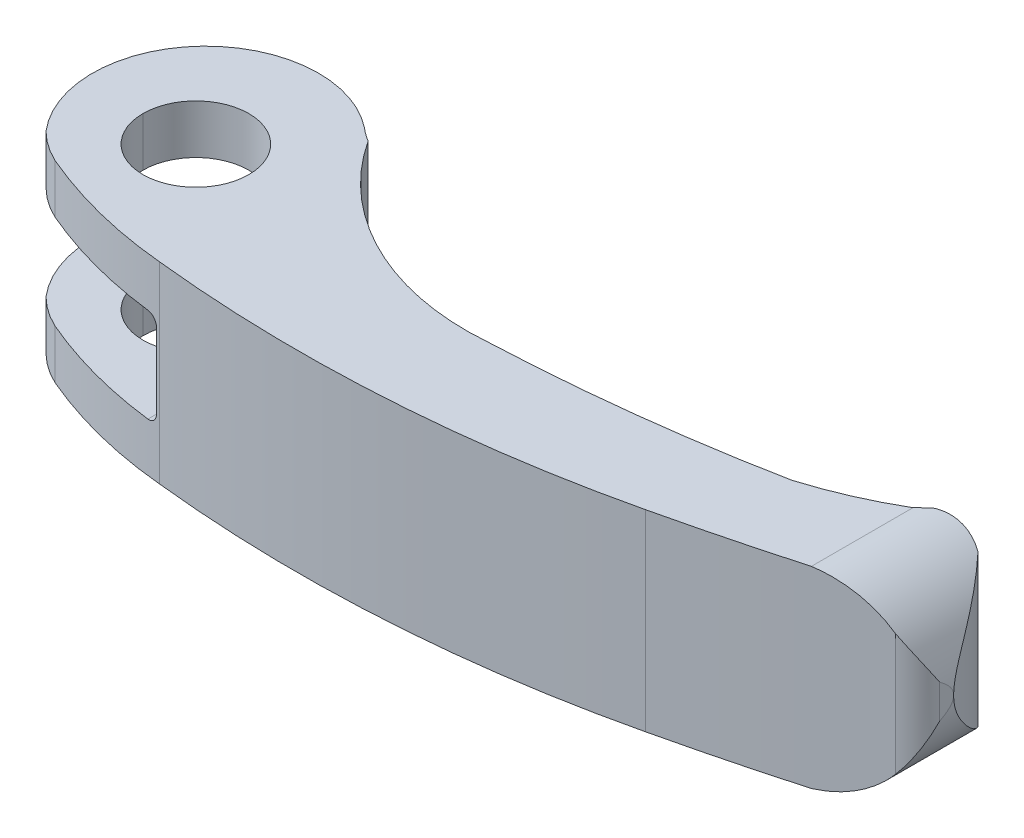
ISO-10303-21;
HEADER;
FILE_DESCRIPTION(('STEP AP214'),'2;1');
FILE_NAME('part.step','',(''),(''),'','','');
FILE_SCHEMA(('AUTOMOTIVE_DESIGN { 1 0 10303 214 1 1 1 1 }'));
ENDSEC;
DATA;
#1=APPLICATION_CONTEXT('core data for automotive mechanical design processes');
#2=APPLICATION_PROTOCOL_DEFINITION('international standard','automotive_design',2000,#1);
#3=PRODUCT_CONTEXT('',#1,'mechanical');
#4=PRODUCT('Part','Part','',(#3));
#5=PRODUCT_RELATED_PRODUCT_CATEGORY('part','',(#4));
#6=PRODUCT_DEFINITION_FORMATION('','',#4);
#7=PRODUCT_DEFINITION_CONTEXT('part definition',#1,'design');
#8=PRODUCT_DEFINITION('design','',#6,#7);
#9=PRODUCT_DEFINITION_SHAPE('','',#8);
#10=(LENGTH_UNIT() NAMED_UNIT(*) SI_UNIT(.MILLI.,.METRE.));
#11=(NAMED_UNIT(*) PLANE_ANGLE_UNIT() SI_UNIT($,.RADIAN.));
#12=(NAMED_UNIT(*) SI_UNIT($,.STERADIAN.) SOLID_ANGLE_UNIT());
#13=UNCERTAINTY_MEASURE_WITH_UNIT(LENGTH_MEASURE(1.E-05),#10,'distance_accuracy_value','');
#14=(GEOMETRIC_REPRESENTATION_CONTEXT(3) GLOBAL_UNCERTAINTY_ASSIGNED_CONTEXT((#13)) GLOBAL_UNIT_ASSIGNED_CONTEXT((#10,
#11,#12)) REPRESENTATION_CONTEXT('',''));
#15=CARTESIAN_POINT('',(0.,0.,0.));
#16=DIRECTION('',(0.,0.,1.));
#17=DIRECTION('',(1.,0.,0.));
#18=AXIS2_PLACEMENT_3D('',#15,#16,#17);
#19=CARTESIAN_POINT('',(7.36000000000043,-3.9,-19.75));
#20=DIRECTION('',(0.,0.,1.));
#21=DIRECTION('',(0.,-1.,0.));
#22=AXIS2_PLACEMENT_3D('',#19,#20,#21);
#23=CYLINDRICAL_SURFACE('',#22,1.);
#24=CARTESIAN_POINT('',(8.35999999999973,-3.9,12.455374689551));
#25=CARTESIAN_POINT('',(8.3599998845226,-3.92802905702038,12.4553745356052));
#26=CARTESIAN_POINT('',(8.35882081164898,-3.95604465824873,12.4552580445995));
#27=CARTESIAN_POINT('',(8.35411748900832,-4.01187475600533,12.4547924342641));
#28=CARTESIAN_POINT('',(8.35059337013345,-4.03968926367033,12.4544433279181));
#29=CARTESIAN_POINT('',(8.3365389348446,-4.12247690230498,12.4530487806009));
#30=CARTESIAN_POINT('',(8.32252643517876,-4.17689446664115,12.4516561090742));
#31=CARTESIAN_POINT('',(8.28561560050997,-4.2825899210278,12.447960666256));
#32=CARTESIAN_POINT('',(8.26271334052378,-4.33386641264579,12.4456574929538));
#33=CARTESIAN_POINT('',(8.20869117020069,-4.4318365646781,12.440170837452));
#34=CARTESIAN_POINT('',(8.17757244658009,-4.47853088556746,12.4369874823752));
#35=CARTESIAN_POINT('',(8.10795249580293,-4.56611029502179,12.4297797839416));
#36=CARTESIAN_POINT('',(8.0694377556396,-4.60698450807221,12.4257539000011));
#37=CARTESIAN_POINT('',(7.98616279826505,-4.68169650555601,12.4169297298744));
#38=CARTESIAN_POINT('',(7.94140135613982,-4.71553290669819,12.4121312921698));
#39=CARTESIAN_POINT('',(7.84669092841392,-4.77537778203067,12.401827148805));
#40=CARTESIAN_POINT('',(7.79671775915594,-4.80134736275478,12.3963181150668));
#41=CARTESIAN_POINT('',(7.69319254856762,-4.84452319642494,12.3847271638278));
#42=CARTESIAN_POINT('',(7.63964223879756,-4.86173365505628,12.3786455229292));
#43=CARTESIAN_POINT('',(7.54816582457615,-4.88286932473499,12.3680931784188));
#44=CARTESIAN_POINT('',(7.51078341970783,-4.88929051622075,12.3637370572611));
#45=CARTESIAN_POINT('',(7.43560361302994,-4.89785540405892,12.3548860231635));
#46=CARTESIAN_POINT('',(7.39780689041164,-4.90000527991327,12.3503913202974));
#47=CARTESIAN_POINT('',(7.3599999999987,-4.9,12.3458483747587));
#48=B_SPLINE_CURVE_WITH_KNOTS('',3,(#24,#25,#26,#27,#28,#29,#30,#31,#32,#33,#34,#35,#36,#37,#38,
#39,#40,#41,#42,#43,#44,#45,#46,#47),.UNSPECIFIED.,.F.,.F.,(4,2,2,2,2,2,2,2,2,2,2,4),(0.,
0.0840354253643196,0.168066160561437,0.3358305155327,0.503669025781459,0.671483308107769,
0.83960716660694,1.00776403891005,1.17673919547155,1.34563314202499,1.45994348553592,
1.57408833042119),.UNSPECIFIED.);
#49=CARTESIAN_POINT('',(8.35999999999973,-3.9,12.455374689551));
#50=VERTEX_POINT('',#49);
#51=CARTESIAN_POINT('',(7.35999999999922,-4.9,12.3458483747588));
#52=VERTEX_POINT('',#51);
#53=EDGE_CURVE('E18',#50,#52,#48,.T.);
#54=ORIENTED_EDGE('',*,*,#53,.F.);
#55=DIRECTION('',(0.,0.,1.));
#56=VECTOR('',#55,1.);
#57=CARTESIAN_POINT('',(8.36000000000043,-3.9,-19.75));
#58=LINE('',#57,#56);
#59=CARTESIAN_POINT('',(8.35999999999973,-3.9,-9.41926238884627));
#60=VERTEX_POINT('',#59);
#61=EDGE_CURVE('E409',#50,#60,#58,.F.);
#62=ORIENTED_EDGE('',*,*,#61,.T.);
#63=CARTESIAN_POINT('',(8.36000000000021,-3.9,-9.41926238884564));
#64=CARTESIAN_POINT('',(8.36000175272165,-3.92464032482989,-9.41926193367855));
#65=CARTESIAN_POINT('',(8.35908854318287,-3.94926765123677,-9.41986322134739));
#66=CARTESIAN_POINT('',(8.35545831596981,-3.99832241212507,-9.4222579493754));
#67=CARTESIAN_POINT('',(8.35274191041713,-4.02274991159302,-9.42405098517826));
#68=CARTESIAN_POINT('',(8.34196477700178,-4.0952370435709,-9.43117577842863));
#69=CARTESIAN_POINT('',(8.33127549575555,-4.14276904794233,-9.43825352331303));
#70=CARTESIAN_POINT('',(8.30347639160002,-4.23492049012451,-9.45678519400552));
#71=CARTESIAN_POINT('',(8.28637218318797,-4.27954243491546,-9.46823529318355));
#72=CARTESIAN_POINT('',(8.24658516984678,-4.3649607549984,-9.4951100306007));
#73=CARTESIAN_POINT('',(8.22389773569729,-4.40575391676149,-9.51053796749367));
#74=CARTESIAN_POINT('',(8.1726377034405,-4.48476644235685,-9.54577369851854));
#75=CARTESIAN_POINT('',(8.14382157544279,-4.52274388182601,-9.56576662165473));
#76=CARTESIAN_POINT('',(8.08225325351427,-4.59321151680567,-9.60903871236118));
#77=CARTESIAN_POINT('',(8.04949981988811,-4.62569997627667,-9.6323189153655));
#78=CARTESIAN_POINT('',(7.97591072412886,-4.68953938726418,-9.68536517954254));
#79=CARTESIAN_POINT('',(7.93460262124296,-4.71997082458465,-9.71557943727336));
#80=CARTESIAN_POINT('',(7.84950566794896,-4.7734498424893,-9.77890881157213));
#81=CARTESIAN_POINT('',(7.80571475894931,-4.79649118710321,-9.81202634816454));
#82=CARTESIAN_POINT('',(7.70809085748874,-4.83925446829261,-9.8871895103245));
#83=CARTESIAN_POINT('',(7.65396424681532,-4.85745395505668,-9.92971713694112));
#84=CARTESIAN_POINT('',(7.54525412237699,-4.88428489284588,-10.0170191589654));
#85=CARTESIAN_POINT('',(7.49067085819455,-4.89292126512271,-10.0617923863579));
#86=CARTESIAN_POINT('',(7.41084261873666,-4.89903439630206,-10.1287039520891));
#87=CARTESIAN_POINT('',(7.38535862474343,-4.89999822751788,-10.1502812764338));
#88=CARTESIAN_POINT('',(7.35999999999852,-4.9,-10.1719752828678));
#89=B_SPLINE_CURVE_WITH_KNOTS('',3,(#63,#64,#65,#66,#67,#68,#69,#70,#71,#72,#73,#74,#75,#76,#77,
#78,#79,#80,#81,#82,#83,#84,#85,#86,#87,#88),.UNSPECIFIED.,.F.,.F.,(4,2,2,2,2,2,2,2,2,2,2,2,4),
(0.,0.0738714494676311,0.147717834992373,0.294618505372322,0.441390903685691,0.588285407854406,
0.742770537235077,0.897304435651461,1.07527129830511,1.25338794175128,1.4662231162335,
1.67894871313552,1.77909531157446),.UNSPECIFIED.);
#90=CARTESIAN_POINT('',(7.36000000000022,-4.9,-10.1719752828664));
#91=VERTEX_POINT('',#90);
#92=EDGE_CURVE('E207',#60,#91,#89,.T.);
#93=ORIENTED_EDGE('',*,*,#92,.T.);
#94=DIRECTION('',(0.,0.,1.));
#95=VECTOR('',#94,1.);
#96=CARTESIAN_POINT('',(7.36000000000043,-4.9,-19.75));
#97=LINE('',#96,#95);
#98=EDGE_CURVE('E205',#91,#52,#97,.T.);
#99=ORIENTED_EDGE('',*,*,#98,.T.);
#100=EDGE_LOOP('',(#54,#62,#93,#99));
#101=FACE_BOUND('',#100,.T.);
#102=ADVANCED_FACE('F14',(#101),#23,.F.);
#103=CARTESIAN_POINT('',(0.000156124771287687,10.,-0.9999951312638));
#104=DIRECTION('',(0.,-1.,0.));
#105=DIRECTION('',(1.,0.,0.));
#106=AXIS2_PLACEMENT_3D('',#103,#104,#105);
#107=CYLINDRICAL_SURFACE('',#106,11.76269371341);
#108=DIRECTION('',(0.,-1.,0.));
#109=VECTOR('',#108,1.);
#110=CARTESIAN_POINT('',(-8.95844613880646,10.,6.62262967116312));
#111=LINE('',#110,#109);
#112=CARTESIAN_POINT('',(-8.95844613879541,-4.9,6.62262967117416));
#113=VERTEX_POINT('',#112);
#114=CARTESIAN_POINT('',(-8.95844613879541,-10.,6.62262967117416));
#115=VERTEX_POINT('',#114);
#116=EDGE_CURVE('E410',#113,#115,#111,.T.);
#117=ORIENTED_EDGE('',*,*,#116,.F.);
#118=CARTESIAN_POINT('',(0.000156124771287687,-4.9,-0.9999951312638));
#119=DIRECTION('',(0.,-1.,0.));
#120=DIRECTION('',(1.,0.,0.));
#121=AXIS2_PLACEMENT_3D('',#118,#119,#120);
#122=CIRCLE('',#121,11.76269371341);
#123=CARTESIAN_POINT('',(7.30256289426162,-4.9,-10.2214819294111));
#124=VERTEX_POINT('',#123);
#125=EDGE_CURVE('E212',#113,#124,#122,.T.);
#126=ORIENTED_EDGE('',*,*,#125,.T.);
#127=DIRECTION('',(0.,-1.,0.));
#128=VECTOR('',#127,1.);
#129=CARTESIAN_POINT('',(7.30256289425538,10.,-10.2214819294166));
#130=LINE('',#129,#128);
#131=CARTESIAN_POINT('',(7.30256289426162,-10.,-10.2214819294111));
#132=VERTEX_POINT('',#131);
#133=EDGE_CURVE('E421',#124,#132,#130,.T.);
#134=ORIENTED_EDGE('',*,*,#133,.T.);
#135=CARTESIAN_POINT('',(0.000156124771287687,-10.,-0.9999951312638));
#136=DIRECTION('',(0.,-1.,0.));
#137=DIRECTION('',(1.,0.,0.));
#138=AXIS2_PLACEMENT_3D('',#135,#136,#137);
#139=CIRCLE('',#138,11.76269371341);
#140=EDGE_CURVE('E376',#115,#132,#139,.T.);
#141=ORIENTED_EDGE('',*,*,#140,.F.);
#142=EDGE_LOOP('',(#117,#126,#134,#141));
#143=FACE_BOUND('',#142,.T.);
#144=ADVANCED_FACE('F550',(#143),#107,.T.);
#145=CARTESIAN_POINT('',(0.,20.,0.));
#146=DIRECTION('',(0.,-1.,0.));
#147=DIRECTION('',(1.,0.,0.));
#148=AXIS2_PLACEMENT_3D('',#145,#146,#147);
#149=CYLINDRICAL_SURFACE('',#148,5.5);
#150=CARTESIAN_POINT('',(0.,-4.9,0.));
#151=DIRECTION('',(0.,-1.,0.));
#152=DIRECTION('',(1.,0.,0.));
#153=AXIS2_PLACEMENT_3D('',#150,#151,#152);
#154=CIRCLE('',#153,5.5);
#155=CARTESIAN_POINT('',(5.5,-4.9,1.19708338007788E-13));
#156=VERTEX_POINT('',#155);
#157=CARTESIAN_POINT('',(-5.5,-4.9,-1.19708338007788E-13));
#158=VERTEX_POINT('',#157);
#159=EDGE_CURVE('E542',#156,#158,#154,.F.);
#160=ORIENTED_EDGE('',*,*,#159,.T.);
#161=DIRECTION('',(0.,-1.,0.));
#162=VECTOR('',#161,1.);
#163=CARTESIAN_POINT('',(-5.5,20.,-1.19708338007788E-13));
#164=LINE('',#163,#162);
#165=CARTESIAN_POINT('',(-5.5,-10.,-1.19708338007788E-13));
#166=VERTEX_POINT('',#165);
#167=EDGE_CURVE('E417',#158,#166,#164,.T.);
#168=ORIENTED_EDGE('',*,*,#167,.T.);
#169=CARTESIAN_POINT('',(0.,-10.,0.));
#170=DIRECTION('',(0.,-1.,0.));
#171=DIRECTION('',(1.,0.,0.));
#172=AXIS2_PLACEMENT_3D('',#169,#170,#171);
#173=CIRCLE('',#172,5.5);
#174=CARTESIAN_POINT('',(5.5,-10.,1.20381893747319E-13));
#175=VERTEX_POINT('',#174);
#176=EDGE_CURVE('E381',#175,#166,#173,.F.);
#177=ORIENTED_EDGE('',*,*,#176,.F.);
#178=DIRECTION('',(0.,-1.,0.));
#179=VECTOR('',#178,1.);
#180=CARTESIAN_POINT('',(5.5,20.,1.20381893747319E-13));
#181=LINE('',#180,#179);
#182=EDGE_CURVE('E203',#175,#156,#181,.F.);
#183=ORIENTED_EDGE('',*,*,#182,.T.);
#184=EDGE_LOOP('',(#160,#168,#177,#183));
#185=FACE_BOUND('',#184,.T.);
#186=ADVANCED_FACE('F622',(#185),#149,.F.);
#187=CARTESIAN_POINT('',(0.,20.,0.));
#188=DIRECTION('',(0.,-1.,0.));
#189=DIRECTION('',(1.,0.,0.));
#190=AXIS2_PLACEMENT_3D('',#187,#188,#189);
#191=CYLINDRICAL_SURFACE('',#190,5.5);
#192=CARTESIAN_POINT('',(0.,-4.9,0.));
#193=DIRECTION('',(0.,-1.,0.));
#194=DIRECTION('',(1.,0.,0.));
#195=AXIS2_PLACEMENT_3D('',#192,#193,#194);
#196=CIRCLE('',#195,5.5);
#197=EDGE_CURVE('E545',#158,#156,#196,.F.);
#198=ORIENTED_EDGE('',*,*,#197,.T.);
#199=ORIENTED_EDGE('',*,*,#182,.F.);
#200=CARTESIAN_POINT('',(0.,-10.,0.));
#201=DIRECTION('',(0.,-1.,0.));
#202=DIRECTION('',(1.,0.,0.));
#203=AXIS2_PLACEMENT_3D('',#200,#201,#202);
#204=CIRCLE('',#203,5.5);
#205=EDGE_CURVE('E382',#166,#175,#204,.F.);
#206=ORIENTED_EDGE('',*,*,#205,.F.);
#207=ORIENTED_EDGE('',*,*,#167,.F.);
#208=EDGE_LOOP('',(#198,#199,#206,#207));
#209=FACE_BOUND('',#208,.T.);
#210=ADVANCED_FACE('F618',(#209),#191,.F.);
#211=CARTESIAN_POINT('',(7.36000000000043,3.9,-19.75));
#212=DIRECTION('',(0.,0.,1.));
#213=DIRECTION('',(0.,-1.,0.));
#214=AXIS2_PLACEMENT_3D('',#211,#212,#213);
#215=CYLINDRICAL_SURFACE('',#214,1.);
#216=CARTESIAN_POINT('',(7.3599999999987,4.9,12.3458483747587));
#217=CARTESIAN_POINT('',(7.38823334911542,4.89999970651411,12.349240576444));
#218=CARTESIAN_POINT('',(7.41645638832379,4.89880356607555,12.3526057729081));
#219=CARTESIAN_POINT('',(7.4727082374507,4.89402942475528,12.359262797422));
#220=CARTESIAN_POINT('',(7.50073705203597,4.89045148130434,12.3625546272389));
#221=CARTESIAN_POINT('',(7.58419462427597,4.87617315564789,12.3722820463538));
#222=CARTESIAN_POINT('',(7.63907577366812,4.86192821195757,12.3785793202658));
#223=CARTESIAN_POINT('',(7.74570534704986,4.82435545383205,12.3906369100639));
#224=CARTESIAN_POINT('',(7.79745188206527,4.80102222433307,12.3963969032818));
#225=CARTESIAN_POINT('',(7.89630743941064,4.74591589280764,12.407251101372));
#226=CARTESIAN_POINT('',(7.94341763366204,4.71414493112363,12.4123454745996));
#227=CARTESIAN_POINT('',(8.03145436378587,4.64319135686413,12.4217493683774));
#228=CARTESIAN_POINT('',(8.07240480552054,4.60403880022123,12.4260619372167));
#229=CARTESIAN_POINT('',(8.14715930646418,4.51933094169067,12.4338534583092));
#230=CARTESIAN_POINT('',(8.18096200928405,4.47377442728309,12.4373322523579));
#231=CARTESIAN_POINT('',(8.24024701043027,4.37783764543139,12.4433848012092));
#232=CARTESIAN_POINT('',(8.2657742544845,4.32748542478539,12.4459634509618));
#233=CARTESIAN_POINT('',(8.30800325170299,4.2231869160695,12.4502066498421));
#234=CARTESIAN_POINT('',(8.32471081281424,4.16924301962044,12.4518718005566));
#235=CARTESIAN_POINT('',(8.34448857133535,4.07911754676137,12.4538381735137));
#236=CARTESIAN_POINT('',(8.35030194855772,4.0435200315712,12.4544145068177));
#237=CARTESIAN_POINT('',(8.3580569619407,3.97195349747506,12.4551824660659));
#238=CARTESIAN_POINT('',(8.36000414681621,3.93598508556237,12.455374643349));
#239=CARTESIAN_POINT('',(8.35999999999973,3.9,12.455374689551));
#240=B_SPLINE_CURVE_WITH_KNOTS('',3,(#216,#217,#218,#219,#220,#221,#222,#223,#224,#225,#226,
#227,#228,#229,#230,#231,#232,#233,#234,#235,#236,#237,#238,#239),.UNSPECIFIED.,.F.,.F.,(4,2,2,
2,2,2,2,2,2,2,2,4),(0.,0.0852572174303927,0.170512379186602,0.340780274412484,0.511149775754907,
0.681476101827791,0.851123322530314,1.02080270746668,1.18954445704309,1.35817494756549,
1.46619968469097,1.57406927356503),.UNSPECIFIED.);
#241=CARTESIAN_POINT('',(7.35999999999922,4.9,12.3458483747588));
#242=VERTEX_POINT('',#241);
#243=CARTESIAN_POINT('',(8.35999999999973,3.9,12.455374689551));
#244=VERTEX_POINT('',#243);
#245=EDGE_CURVE('E416',#242,#244,#240,.T.);
#246=ORIENTED_EDGE('',*,*,#245,.F.);
#247=DIRECTION('',(0.,0.,1.));
#248=VECTOR('',#247,1.);
#249=CARTESIAN_POINT('',(7.36000000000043,4.9,-19.75));
#250=LINE('',#249,#248);
#251=CARTESIAN_POINT('',(7.35999999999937,4.9,-10.1719752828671));
#252=VERTEX_POINT('',#251);
#253=EDGE_CURVE('E400',#242,#252,#250,.F.);
#254=ORIENTED_EDGE('',*,*,#253,.T.);
#255=CARTESIAN_POINT('',(7.35999999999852,4.9,-10.1719752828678));
#256=CARTESIAN_POINT('',(7.39206769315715,4.89999320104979,-10.1445446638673));
#257=CARTESIAN_POINT('',(7.42429718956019,4.89845630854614,-10.1173282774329));
#258=CARTESIAN_POINT('',(7.48894748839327,4.89218592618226,-10.063423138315));
#259=CARTESIAN_POINT('',(7.52136846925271,4.88744873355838,-10.0367350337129));
#260=CARTESIAN_POINT('',(7.61900355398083,4.86815843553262,-9.95738511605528));
#261=CARTESIAN_POINT('',(7.68419309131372,4.84852314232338,-9.90577673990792));
#262=CARTESIAN_POINT('',(7.79965313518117,4.79991254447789,-9.81657299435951));
#263=CARTESIAN_POINT('',(7.8503836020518,4.77345660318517,-9.77819039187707));
#264=CARTESIAN_POINT('',(7.94834187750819,4.71069048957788,-9.70542984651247));
#265=CARTESIAN_POINT('',(7.99558029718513,4.67441187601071,-9.67103957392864));
#266=CARTESIAN_POINT('',(8.07705911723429,4.59883937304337,-9.61268013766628));
#267=CARTESIAN_POINT('',(8.11215110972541,4.56106968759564,-9.58793039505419));
#268=CARTESIAN_POINT('',(8.17706058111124,4.47892009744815,-9.54268108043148));
#269=CARTESIAN_POINT('',(8.20687658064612,4.43453834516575,-9.52218270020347));
#270=CARTESIAN_POINT('',(8.25983183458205,4.33963303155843,-9.48610367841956));
#271=CARTESIAN_POINT('',(8.28292101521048,4.28906719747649,-9.47055984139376));
#272=CARTESIAN_POINT('',(8.32059201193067,4.18352385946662,-9.44534514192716));
#273=CARTESIAN_POINT('',(8.33519012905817,4.12855504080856,-9.43566302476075));
#274=CARTESIAN_POINT('',(8.34998423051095,4.04410128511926,-9.42587219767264));
#275=CARTESIAN_POINT('',(8.35373238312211,4.01546008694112,-9.42339700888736));
#276=CARTESIAN_POINT('',(8.3587412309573,3.95788608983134,-9.42009215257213));
#277=CARTESIAN_POINT('',(8.36000353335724,3.92895349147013,-9.41926142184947));
#278=CARTESIAN_POINT('',(8.36000000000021,3.9,-9.41926238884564));
#279=B_SPLINE_CURVE_WITH_KNOTS('',3,(#255,#256,#257,#258,#259,#260,#261,#262,#263,#264,#265,
#266,#267,#268,#269,#270,#271,#272,#273,#274,#275,#276,#277,#278),.UNSPECIFIED.,.F.,.F.,(4,2,2,
2,2,2,2,2,2,2,2,4),(0.,0.126530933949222,0.25320851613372,0.508112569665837,0.714041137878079,
0.919315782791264,1.09018928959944,1.26111063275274,1.4332735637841,1.60510487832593,
1.691941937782,1.77872283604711),.UNSPECIFIED.);
#280=CARTESIAN_POINT('',(8.35999999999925,3.9,-9.41926238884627));
#281=VERTEX_POINT('',#280);
#282=EDGE_CURVE('E360',#252,#281,#279,.T.);
#283=ORIENTED_EDGE('',*,*,#282,.T.);
#284=DIRECTION('',(0.,0.,1.));
#285=VECTOR('',#284,1.);
#286=CARTESIAN_POINT('',(8.36000000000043,3.9,-19.75));
#287=LINE('',#286,#285);
#288=EDGE_CURVE('E406',#281,#244,#287,.T.);
#289=ORIENTED_EDGE('',*,*,#288,.T.);
#290=EDGE_LOOP('',(#246,#254,#283,#289));
#291=FACE_BOUND('',#290,.T.);
#292=ADVANCED_FACE('F554',(#291),#215,.F.);
#293=CARTESIAN_POINT('',(79.,10.,0.234035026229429));
#294=DIRECTION('',(0.993149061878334,0.,0.116854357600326));
#295=DIRECTION('',(-0.116854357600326,0.,0.993149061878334));
#296=AXIS2_PLACEMENT_3D('',#293,#294,#295);
#297=PLANE('',#296);
#298=DIRECTION('',(0.,-1.,0.));
#299=VECTOR('',#298,1.);
#300=CARTESIAN_POINT('',(78.8474338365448,10.,1.5306999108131));
#301=LINE('',#300,#299);
#302=CARTESIAN_POINT('',(78.8474338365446,-1.74499244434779,1.53069991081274));
#303=VERTEX_POINT('',#302);
#304=CARTESIAN_POINT('',(78.8474338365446,1.74499244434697,1.53069991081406));
#305=VERTEX_POINT('',#304);
#306=EDGE_CURVE('E412',#303,#305,#301,.F.);
#307=ORIENTED_EDGE('',*,*,#306,.F.);
#308=CARTESIAN_POINT('',(68.9444444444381,0.,85.6965352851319));
#309=DIRECTION('',(0.993149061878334,0.,0.116854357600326));
#310=DIRECTION('',(-0.116854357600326,0.,0.993149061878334));
#311=AXIS2_PLACEMENT_3D('',#308,#309,#310);
#312=ELLIPSE('',#311,86.0520374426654,10.05555555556);
#313=CARTESIAN_POINT('',(79.,-7.93927320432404E-07,0.234035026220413));
#314=VERTEX_POINT('',#313);
#315=EDGE_CURVE('E289',#314,#303,#312,.F.);
#316=ORIENTED_EDGE('',*,*,#315,.F.);
#317=CARTESIAN_POINT('',(68.9444444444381,0.,85.6965352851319));
#318=DIRECTION('',(0.993149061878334,0.,0.116854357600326));
#319=DIRECTION('',(-0.116854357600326,0.,0.993149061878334));
#320=AXIS2_PLACEMENT_3D('',#317,#318,#319);
#321=ELLIPSE('',#320,86.0520374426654,10.05555555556);
#322=EDGE_CURVE('E314',#305,#314,#321,.F.);
#323=ORIENTED_EDGE('',*,*,#322,.F.);
#324=EDGE_LOOP('',(#307,#316,#323));
#325=FACE_BOUND('',#324,.T.);
#326=ADVANCED_FACE('F300',(#325),#297,.T.);
#327=CARTESIAN_POINT('',(61.2713887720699,10.,6.56919871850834));
#328=DIRECTION('',(0.,-1.,0.));
#329=DIRECTION('',(1.,0.,0.));
#330=AXIS2_PLACEMENT_3D('',#327,#328,#329);
#331=CYLINDRICAL_SURFACE('',#330,18.82652264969);
#332=DIRECTION('',(0.,-1.,0.));
#333=VECTOR('',#332,1.);
#334=CARTESIAN_POINT('',(75.2092949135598,10.,-6.08673773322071));
#335=LINE('',#334,#333);
#336=CARTESIAN_POINT('',(75.2092949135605,7.86548448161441,-6.0867377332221));
#337=VERTEX_POINT('',#336);
#338=CARTESIAN_POINT('',(75.2092949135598,-7.86548448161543,-6.08673773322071));
#339=VERTEX_POINT('',#338);
#340=EDGE_CURVE('E414',#337,#339,#335,.T.);
#341=ORIENTED_EDGE('',*,*,#340,.F.);
#342=CARTESIAN_POINT('',(79.0000000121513,-7.93927366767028E-07,0.234035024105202));
#343=CARTESIAN_POINT('',(79.0000281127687,0.12149842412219,0.234151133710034));
#344=CARTESIAN_POINT('',(78.9977992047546,0.242915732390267,0.227876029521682));
#345=CARTESIAN_POINT('',(78.9890565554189,0.484077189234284,0.203470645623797));
#346=CARTESIAN_POINT('',(78.9825544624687,0.603824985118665,0.185372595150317));
#347=CARTESIAN_POINT('',(78.9656682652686,0.838367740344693,0.138725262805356));
#348=CARTESIAN_POINT('',(78.9553669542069,0.95321391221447,0.110399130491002));
#349=CARTESIAN_POINT('',(78.9311860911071,1.17991018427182,0.0445721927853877));
#350=CARTESIAN_POINT('',(78.9173039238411,1.29175802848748,0.00706468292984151));
#351=CARTESIAN_POINT('',(78.8796959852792,1.5588816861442,-0.093339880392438));
#352=CARTESIAN_POINT('',(78.854294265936,1.71240877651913,-0.160252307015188));
#353=CARTESIAN_POINT('',(78.7977475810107,2.01245032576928,-0.306179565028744));
#354=CARTESIAN_POINT('',(78.766599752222,2.1589612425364,-0.385200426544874));
#355=CARTESIAN_POINT('',(78.6988749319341,2.4469133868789,-0.553228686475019));
#356=CARTESIAN_POINT('',(78.6622444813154,2.58828542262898,-0.642332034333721));
#357=CARTESIAN_POINT('',(78.5842764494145,2.86505042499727,-0.827556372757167));
#358=CARTESIAN_POINT('',(78.5429367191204,3.00044062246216,-0.923680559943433));
#359=CARTESIAN_POINT('',(78.4521779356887,3.27722383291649,-1.12964251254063));
#360=CARTESIAN_POINT('',(78.4023701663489,3.41813799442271,-1.23994972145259));
#361=CARTESIAN_POINT('',(78.2979298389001,3.69435818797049,-1.46512088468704));
#362=CARTESIAN_POINT('',(78.2432978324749,3.8296648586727,-1.57998431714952));
#363=CARTESIAN_POINT('',(78.07233344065,4.22844204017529,-1.92982710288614));
#364=CARTESIAN_POINT('',(77.9490179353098,4.48451448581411,-2.16986251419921));
#365=CARTESIAN_POINT('',(77.6848473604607,4.9797658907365,-2.65647581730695));
#366=CARTESIAN_POINT('',(77.5440207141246,5.21897126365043,-2.90304260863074));
#367=CARTESIAN_POINT('',(77.2449202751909,5.68263546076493,-3.39915571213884));
#368=CARTESIAN_POINT('',(77.0866558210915,5.90710207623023,-3.64870036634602));
#369=CARTESIAN_POINT('',(76.7961931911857,6.28532118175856,-4.08292501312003));
#370=CARTESIAN_POINT('',(76.6679754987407,6.44223699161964,-4.26753238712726));
#371=CARTESIAN_POINT('',(76.4018735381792,6.74848850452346,-4.63606932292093));
#372=CARTESIAN_POINT('',(76.2639895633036,6.89782443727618,-4.81999890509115));
#373=CARTESIAN_POINT('',(75.9790002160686,7.18821752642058,-5.18570040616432));
#374=CARTESIAN_POINT('',(75.8319317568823,7.32930390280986,-5.36747785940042));
#375=CARTESIAN_POINT('',(75.5279895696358,7.60348134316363,-5.72889403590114));
#376=CARTESIAN_POINT('',(75.3711147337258,7.73657150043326,-5.90853251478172));
#377=CARTESIAN_POINT('',(75.209294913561,7.86548448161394,-6.08673773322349));
#378=B_SPLINE_CURVE_WITH_KNOTS('',3,(#342,#343,#344,#345,#346,#347,#348,#349,#350,#351,#352,
#353,#354,#355,#356,#357,#358,#359,#360,#361,#362,#363,#364,#365,#366,#367,#368,#369,#370,#371,
#372,#373,#374,#375,#376,#377),.UNSPECIFIED.,.F.,.F.,(4,2,2,2,2,2,2,2,2,2,2,2,2,2,2,2,2,4),(0.,
0.364184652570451,0.72738066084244,1.08308918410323,1.43905823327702,1.94633544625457,
2.45386611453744,2.9667138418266,3.47979654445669,4.0368182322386,4.59377630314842,
5.708688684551,6.82181445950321,7.93434699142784,8.75645642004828,9.57854091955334,
10.3975110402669,11.2165738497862),.UNSPECIFIED.);
#379=EDGE_CURVE('E306',#314,#337,#378,.T.);
#380=ORIENTED_EDGE('',*,*,#379,.F.);
#381=CARTESIAN_POINT('',(75.209294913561,-7.86548448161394,-6.08673773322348));
#382=CARTESIAN_POINT('',(75.3357073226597,-7.76478977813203,-5.94752011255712));
#383=CARTESIAN_POINT('',(75.4590935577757,-7.66153989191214,-5.80744423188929));
#384=CARTESIAN_POINT('',(75.6998712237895,-7.45010713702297,-5.52588994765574));
#385=CARTESIAN_POINT('',(75.8172630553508,-7.34192459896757,-5.38441163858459));
#386=CARTESIAN_POINT('',(76.1606193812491,-7.01016400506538,-4.95823967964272));
#387=CARTESIAN_POINT('',(76.377696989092,-6.77942714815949,-4.67188397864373));
#388=CARTESIAN_POINT('',(76.7865579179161,-6.30185683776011,-4.10037703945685));
#389=CARTESIAN_POINT('',(76.9785522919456,-6.05518787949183,-3.81523833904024));
#390=CARTESIAN_POINT('',(77.3397514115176,-5.54356717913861,-3.24705128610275));
#391=CARTESIAN_POINT('',(77.5089649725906,-5.27862256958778,-2.96400216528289));
#392=CARTESIAN_POINT('',(77.7435105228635,-4.86974099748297,-2.54845690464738));
#393=CARTESIAN_POINT('',(77.8175827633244,-4.73349390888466,-2.4132554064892));
#394=CARTESIAN_POINT('',(77.9602411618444,-4.45578209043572,-2.14533877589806));
#395=CARTESIAN_POINT('',(78.0288277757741,-4.31431779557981,-2.01262343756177));
#396=CARTESIAN_POINT('',(78.1609010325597,-4.02451005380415,-1.74970373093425));
#397=CARTESIAN_POINT('',(78.2243442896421,-3.87612198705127,-1.61952660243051));
#398=CARTESIAN_POINT('',(78.3453120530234,-3.57275158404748,-1.3642141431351));
#399=CARTESIAN_POINT('',(78.4028374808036,-3.41777027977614,-1.23907802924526));
#400=CARTESIAN_POINT('',(78.5126150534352,-3.09734105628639,-0.993635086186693));
#401=CARTESIAN_POINT('',(78.5647527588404,-2.93175436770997,-0.873456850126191));
#402=CARTESIAN_POINT('',(78.6619783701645,-2.59134690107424,-0.643355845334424));
#403=CARTESIAN_POINT('',(78.707061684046,-2.41652020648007,-0.533439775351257));
#404=CARTESIAN_POINT('',(78.7886279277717,-2.05898662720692,-0.329797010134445));
#405=CARTESIAN_POINT('',(78.8252216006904,-1.87642289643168,-0.235866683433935));
#406=CARTESIAN_POINT('',(78.8892056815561,-1.5006791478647,-0.0684616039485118));
#407=CARTESIAN_POINT('',(78.9166147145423,-1.30752155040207,0.00505449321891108));
#408=CARTESIAN_POINT('',(78.9484477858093,-1.02084144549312,0.0915170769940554));
#409=CARTESIAN_POINT('',(78.9572140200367,-0.931080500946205,0.115514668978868));
#410=CARTESIAN_POINT('',(78.9724073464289,-0.749940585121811,0.157304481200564));
#411=CARTESIAN_POINT('',(78.9788352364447,-0.658562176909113,0.175098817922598));
#412=CARTESIAN_POINT('',(78.9893022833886,-0.473058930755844,0.204157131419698));
#413=CARTESIAN_POINT('',(78.9932997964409,-0.378913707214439,0.2153071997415));
#414=CARTESIAN_POINT('',(78.9986558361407,-0.18985494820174,0.230273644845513));
#415=CARTESIAN_POINT('',(79.0000111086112,-0.0949406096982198,0.234080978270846));
#416=CARTESIAN_POINT('',(79.,-7.93213282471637E-07,0.234035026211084));
#417=B_SPLINE_CURVE_WITH_KNOTS('',3,(#381,#382,#383,#384,#385,#386,#387,#388,#389,#390,#391,
#392,#393,#394,#395,#396,#397,#398,#399,#400,#401,#402,#403,#404,#405,#406,#407,#408,#409,#410,
#411,#412,#413,#414,#415,#416),.UNSPECIFIED.,.F.,.F.,(4,2,2,2,2,2,2,2,2,2,2,2,2,2,2,2,2,4),(0.,
0.639841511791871,1.27964020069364,2.55958068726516,3.82794256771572,5.09581220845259,
5.71291528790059,6.32996703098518,6.95177503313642,7.57348606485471,8.20646249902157,
8.83984926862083,9.46443986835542,10.0877561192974,10.3675279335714,10.6472041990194,
10.9315466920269,11.216239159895),.UNSPECIFIED.);
#418=EDGE_CURVE('E283',#339,#314,#417,.T.);
#419=ORIENTED_EDGE('',*,*,#418,.F.);
#420=EDGE_LOOP('',(#341,#380,#419));
#421=FACE_BOUND('',#420,.T.);
#422=ADVANCED_FACE('F295',(#421),#331,.T.);
#423=CARTESIAN_POINT('',(73.3760413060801,10.,-2.4823557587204));
#424=DIRECTION('',(0.,-1.,0.));
#425=DIRECTION('',(1.,0.,0.));
#426=AXIS2_PLACEMENT_3D('',#423,#424,#425);
#427=CYLINDRICAL_SURFACE('',#426,4.043808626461);
#428=DIRECTION('',(0.,-1.,0.));
#429=VECTOR('',#428,1.);
#430=CARTESIAN_POINT('',(70.8823742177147,10.,-5.66575216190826));
#431=LINE('',#430,#429);
#432=CARTESIAN_POINT('',(70.8823742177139,-9.86704746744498,-5.66575216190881));
#433=VERTEX_POINT('',#432);
#434=CARTESIAN_POINT('',(70.8823742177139,9.86704746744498,-5.66575216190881));
#435=VERTEX_POINT('',#434);
#436=EDGE_CURVE('E387',#433,#435,#431,.F.);
#437=ORIENTED_EDGE('',*,*,#436,.T.);
#438=CARTESIAN_POINT('',(75.2092949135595,7.86548448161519,-6.08673773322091));
#439=CARTESIAN_POINT('',(75.0842788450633,7.9650988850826,-6.15030895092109));
#440=CARTESIAN_POINT('',(74.9549147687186,8.06322643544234,-6.20793010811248));
#441=CARTESIAN_POINT('',(74.6878734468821,8.25555538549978,-6.31014981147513));
#442=CARTESIAN_POINT('',(74.5501774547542,8.34974705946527,-6.3547175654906));
#443=CARTESIAN_POINT('',(74.2668087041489,8.53318755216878,-6.42956724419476));
#444=CARTESIAN_POINT('',(74.1211027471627,8.62241214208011,-6.4597837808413));
#445=CARTESIAN_POINT('',(73.8235824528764,8.79418197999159,-6.50413094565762));
#446=CARTESIAN_POINT('',(73.6717751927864,8.87673465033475,-6.51827968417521));
#447=CARTESIAN_POINT('',(73.4127918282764,9.00899450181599,-6.52736105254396));
#448=CARTESIAN_POINT('',(73.3068222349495,9.06078034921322,-6.52698300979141));
#449=CARTESIAN_POINT('',(73.0934400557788,9.16045212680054,-6.51768985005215));
#450=CARTESIAN_POINT('',(72.9860278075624,9.20833895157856,-6.50877669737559));
#451=CARTESIAN_POINT('',(72.7708050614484,9.29982810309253,-6.48208152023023));
#452=CARTESIAN_POINT('',(72.6629962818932,9.34344106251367,-6.46432221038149));
#453=CARTESIAN_POINT('',(72.4475962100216,9.42631618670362,-6.41967355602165));
#454=CARTESIAN_POINT('',(72.3400048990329,9.46557874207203,-6.39278503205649));
#455=CARTESIAN_POINT('',(72.133101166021,9.53718237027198,-6.33181521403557));
#456=CARTESIAN_POINT('',(72.0337124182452,9.56980964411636,-6.29832832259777));
#457=CARTESIAN_POINT('',(71.8368111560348,9.63114961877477,-6.22324566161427));
#458=CARTESIAN_POINT('',(71.7392984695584,9.65986268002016,-6.18165063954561));
#459=CARTESIAN_POINT('',(71.547096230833,9.7134106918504,-6.09049272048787));
#460=CARTESIAN_POINT('',(71.4524040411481,9.7382493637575,-6.04093756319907));
#461=CARTESIAN_POINT('',(71.266625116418,9.78421295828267,-5.93405445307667));
#462=CARTESIAN_POINT('',(71.1755363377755,9.80534000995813,-5.87673098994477));
#463=CARTESIAN_POINT('',(71.0518877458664,9.83230136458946,-5.79180902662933));
#464=CARTESIAN_POINT('',(71.0174538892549,9.83961591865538,-5.76735826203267));
#465=CARTESIAN_POINT('',(70.949347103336,9.85371856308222,-5.71737109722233));
#466=CARTESIAN_POINT('',(70.9156732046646,9.86050735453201,-5.69183621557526));
#467=CARTESIAN_POINT('',(70.8823742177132,9.86704746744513,-5.66575216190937));
#468=B_SPLINE_CURVE_WITH_KNOTS('',3,(#438,#439,#440,#441,#442,#443,#444,#445,#446,#447,#448,
#449,#450,#451,#452,#453,#454,#455,#456,#457,#458,#459,#460,#461,#462,#463,#464,#465,#466,#467),
.UNSPECIFIED.,.F.,.F.,(4,2,2,2,2,2,2,2,2,2,2,2,2,2,4),(0.,0.516070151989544,1.03334805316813,
1.55296072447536,2.07198714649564,2.42548598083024,2.7789034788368,3.13141813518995,
3.4839011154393,3.81303648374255,4.14214152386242,4.47092848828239,4.79952623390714,
4.92808948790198,5.0564782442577),.UNSPECIFIED.);
#469=EDGE_CURVE('E313',#337,#435,#468,.T.);
#470=ORIENTED_EDGE('',*,*,#469,.F.);
#471=ORIENTED_EDGE('',*,*,#340,.T.);
#472=CARTESIAN_POINT('',(70.8823742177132,-9.86704746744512,-5.66575216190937));
#473=CARTESIAN_POINT('',(70.9689067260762,-9.85006262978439,-5.73356147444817));
#474=CARTESIAN_POINT('',(71.0580175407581,-9.83136880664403,-5.79764625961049));
#475=CARTESIAN_POINT('',(71.2405292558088,-9.79034639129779,-5.91803345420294));
#476=CARTESIAN_POINT('',(71.333929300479,-9.76801852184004,-5.97433740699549));
#477=CARTESIAN_POINT('',(71.5238199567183,-9.71959849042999,-6.07865462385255));
#478=CARTESIAN_POINT('',(71.6202972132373,-9.69352122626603,-6.12669912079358));
#479=CARTESIAN_POINT('',(71.8158017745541,-9.63741900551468,-6.21458378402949));
#480=CARTESIAN_POINT('',(71.914829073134,-9.60739405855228,-6.25442397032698));
#481=CARTESIAN_POINT('',(72.1145282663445,-9.54336147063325,-6.32581904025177));
#482=CARTESIAN_POINT('',(72.2151995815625,-9.50935520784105,-6.35737677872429));
#483=CARTESIAN_POINT('',(72.4173809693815,-9.43739683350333,-6.41228597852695));
#484=CARTESIAN_POINT('',(72.5188913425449,-9.39944324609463,-6.43563435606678));
#485=CARTESIAN_POINT('',(72.8234389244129,-9.27981465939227,-6.49354365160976));
#486=CARTESIAN_POINT('',(73.0266246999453,-9.19232995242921,-6.51601493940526));
#487=CARTESIAN_POINT('',(73.4364815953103,-8.99941811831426,-6.53115518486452));
#488=CARTESIAN_POINT('',(73.6428952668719,-8.89335881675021,-6.52243144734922));
#489=CARTESIAN_POINT('',(74.0454838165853,-8.66872483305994,-6.47551738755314));
#490=CARTESIAN_POINT('',(74.2416477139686,-8.55013712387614,-6.43729612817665));
#491=CARTESIAN_POINT('',(74.5684794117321,-8.33734798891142,-6.34898012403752));
#492=CARTESIAN_POINT('',(74.7023447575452,-8.24538827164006,-6.30502473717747));
#493=CARTESIAN_POINT('',(74.9619059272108,-8.0579133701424,-6.20480644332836));
#494=CARTESIAN_POINT('',(75.0876322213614,-7.96241383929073,-6.14859335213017));
#495=CARTESIAN_POINT('',(75.2092949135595,-7.86548448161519,-6.08673773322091));
#496=B_SPLINE_CURVE_WITH_KNOTS('',3,(#472,#473,#474,#475,#476,#477,#478,#479,#480,#481,#482,
#483,#484,#485,#486,#487,#488,#489,#490,#491,#492,#493,#494,#495),.UNSPECIFIED.,.F.,.F.,(4,2,2,
2,2,2,2,2,2,2,2,4),(0.,0.333612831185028,0.66715939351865,0.999415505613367,1.33167080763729,
1.66381143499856,1.99607669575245,2.6601741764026,3.35428302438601,4.04912084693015,
4.5532234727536,5.05531437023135),.UNSPECIFIED.);
#497=EDGE_CURVE('E290',#433,#339,#496,.T.);
#498=ORIENTED_EDGE('',*,*,#497,.F.);
#499=EDGE_LOOP('',(#437,#470,#471,#498));
#500=FACE_BOUND('',#499,.T.);
#501=ADVANCED_FACE('F299',(#500),#427,.T.);
#502=CARTESIAN_POINT('',(74.96730551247,10.,0.421382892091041));
#503=DIRECTION('',(0.,-1.,0.));
#504=DIRECTION('',(1.,0.,0.));
#505=AXIS2_PLACEMENT_3D('',#502,#503,#504);
#506=CYLINDRICAL_SURFACE('',#505,4.035589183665);
#507=ORIENTED_EDGE('',*,*,#306,.T.);
#508=CARTESIAN_POINT('',(76.7561832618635,6.33174021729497,4.0388262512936));
#509=CARTESIAN_POINT('',(76.8345528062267,6.23505117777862,4.000065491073));
#510=CARTESIAN_POINT('',(76.9107041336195,6.13743137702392,3.95924441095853));
#511=CARTESIAN_POINT('',(77.0585955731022,5.94053111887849,3.87388670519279));
#512=CARTESIAN_POINT('',(77.13033683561,5.84125110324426,3.82935105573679));
#513=CARTESIAN_POINT('',(77.3388279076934,5.54145460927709,3.69089029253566));
#514=CARTESIAN_POINT('',(77.4690871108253,5.33868151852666,3.59198901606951));
#515=CARTESIAN_POINT('',(77.7105315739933,4.93202775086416,3.38541793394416));
#516=CARTESIAN_POINT('',(77.8220046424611,4.72822515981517,3.27792676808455));
#517=CARTESIAN_POINT('',(78.0290870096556,4.31699800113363,3.05475497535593));
#518=CARTESIAN_POINT('',(78.124691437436,4.1095723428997,2.93907184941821));
#519=CARTESIAN_POINT('',(78.2863400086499,3.72549938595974,2.7203799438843));
#520=CARTESIAN_POINT('',(78.3546655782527,3.54926192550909,2.6183213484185));
#521=CARTESIAN_POINT('',(78.4807017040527,3.19519851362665,2.41055042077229));
#522=CARTESIAN_POINT('',(78.5384139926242,3.01737282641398,2.30483868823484));
#523=CARTESIAN_POINT('',(78.6442416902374,2.65778013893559,2.08895116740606));
#524=CARTESIAN_POINT('',(78.6922029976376,2.47599369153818,1.97873253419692));
#525=CARTESIAN_POINT('',(78.7776361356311,2.11129065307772,1.75613587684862));
#526=CARTESIAN_POINT('',(78.8151084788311,1.92837411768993,1.64375795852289));
#527=CARTESIAN_POINT('',(78.8474338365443,1.74499244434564,1.53069991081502));
#528=B_SPLINE_CURVE_WITH_KNOTS('',3,(#508,#509,#510,#511,#512,#513,#514,#515,#516,#517,#518,
#519,#520,#521,#522,#523,#524,#525,#526,#527),.UNSPECIFIED.,.F.,.F.,(4,2,2,2,2,2,2,2,2,4),(0.,
0.390980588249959,0.781858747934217,1.56240570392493,2.32961955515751,3.09706847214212,
3.74120420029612,4.3852346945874,5.03876416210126,5.6922616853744),.UNSPECIFIED.);
#529=CARTESIAN_POINT('',(76.7561832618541,6.33174021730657,4.03882625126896));
#530=VERTEX_POINT('',#529);
#531=EDGE_CURVE('E502',#530,#305,#528,.T.);
#532=ORIENTED_EDGE('',*,*,#531,.F.);
#533=DIRECTION('',(0.,-1.,0.));
#534=VECTOR('',#533,1.);
#535=CARTESIAN_POINT('',(76.7561832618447,10.,4.03882625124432));
#536=LINE('',#535,#534);
#537=CARTESIAN_POINT('',(76.7561832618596,-6.33174021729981,4.03882625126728));
#538=VERTEX_POINT('',#537);
#539=EDGE_CURVE('E342',#538,#530,#536,.F.);
#540=ORIENTED_EDGE('',*,*,#539,.F.);
#541=CARTESIAN_POINT('',(78.8474338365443,-1.74499244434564,1.53069991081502));
#542=CARTESIAN_POINT('',(78.821740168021,-1.89077356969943,1.62056785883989));
#543=CARTESIAN_POINT('',(78.792795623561,-2.0362329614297,1.70999849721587));
#544=CARTESIAN_POINT('',(78.7283002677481,-2.32647701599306,1.88761167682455));
#545=CARTESIAN_POINT('',(78.6927484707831,-2.47126157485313,1.97579402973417));
#546=CARTESIAN_POINT('',(78.5758586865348,-2.90515774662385,2.23827151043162));
#547=CARTESIAN_POINT('',(78.4844039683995,-3.19313810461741,2.41007843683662));
#548=CARTESIAN_POINT('',(78.2763273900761,-3.75743102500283,2.73942925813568));
#549=CARTESIAN_POINT('',(78.1604042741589,-4.03385410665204,2.89722468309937));
#550=CARTESIAN_POINT('',(77.9011740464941,-4.58067717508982,3.19951027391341));
#551=CARTESIAN_POINT('',(77.757903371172,-4.85108464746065,3.34401776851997));
#552=CARTESIAN_POINT('',(77.4779537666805,-5.32458612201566,3.58503383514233));
#553=CARTESIAN_POINT('',(77.3469440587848,-5.52923046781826,3.68505579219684));
#554=CARTESIAN_POINT('',(77.1365017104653,-5.83264513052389,3.82546451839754));
#555=CARTESIAN_POINT('',(77.0636376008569,-5.93368193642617,3.8708635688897));
#556=CARTESIAN_POINT('',(76.9133426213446,-6.13404806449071,3.95782889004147));
#557=CARTESIAN_POINT('',(76.8359102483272,-6.23337681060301,3.99939388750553));
#558=CARTESIAN_POINT('',(76.7561832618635,-6.33174021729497,4.0388262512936));
#559=B_SPLINE_CURVE_WITH_KNOTS('',3,(#541,#542,#543,#544,#545,#546,#547,#548,#549,#550,#551,
#552,#553,#554,#555,#556,#557,#558),.UNSPECIFIED.,.F.,.F.,(4,2,2,2,2,2,2,2,4),(0.,
0.519450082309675,1.03897771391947,2.08043192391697,3.09541587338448,4.10905683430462,
4.8964000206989,5.29402319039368,5.6917779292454),.UNSPECIFIED.);
#560=EDGE_CURVE('E275',#303,#538,#559,.T.);
#561=ORIENTED_EDGE('',*,*,#560,.F.);
#562=EDGE_LOOP('',(#507,#532,#540,#561));
#563=FACE_BOUND('',#562,.T.);
#564=ADVANCED_FACE('F255',(#563),#506,.T.);
#565=CARTESIAN_POINT('',(68.9444444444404,0.,-19.7499999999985));
#566=DIRECTION('',(0.,0.,1.));
#567=DIRECTION('',(0.,-1.,0.));
#568=AXIS2_PLACEMENT_3D('',#565,#566,#567);
#569=CYLINDRICAL_SURFACE('',#568,10.05555555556);
#570=ORIENTED_EDGE('',*,*,#560,.T.);
#571=CARTESIAN_POINT('',(69.9999999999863,-10.0000000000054,6.02646126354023));
#572=CARTESIAN_POINT('',(70.2891121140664,-9.96950616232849,5.9450985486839));
#573=CARTESIAN_POINT('',(70.5768673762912,-9.92643203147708,5.86363860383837));
#574=CARTESIAN_POINT('',(71.147705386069,-9.81551111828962,5.70113201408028));
#575=CARTESIAN_POINT('',(71.4307877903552,-9.74766252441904,5.62008539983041));
#576=CARTESIAN_POINT('',(71.9910125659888,-9.58737514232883,5.45881396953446));
#577=CARTESIAN_POINT('',(72.2681373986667,-9.49487228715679,5.37859186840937));
#578=CARTESIAN_POINT('',(72.8136887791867,-9.28592757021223,5.21983367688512));
#579=CARTESIAN_POINT('',(73.0821159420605,-9.16948740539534,5.14129746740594));
#580=CARTESIAN_POINT('',(73.608647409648,-8.91320587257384,4.98647188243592));
#581=CARTESIAN_POINT('',(73.8667394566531,-8.77333768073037,4.9101852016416));
#582=CARTESIAN_POINT('',(74.3703354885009,-8.47113492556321,4.76062645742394));
#583=CARTESIAN_POINT('',(74.6158399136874,-8.30880114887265,4.68735428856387));
#584=CARTESIAN_POINT('',(75.0917157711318,-7.9631349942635,4.54469711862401));
#585=CARTESIAN_POINT('',(75.3221262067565,-7.77986039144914,4.47530217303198));
#586=CARTESIAN_POINT('',(75.7665872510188,-7.39318879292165,4.3408931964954));
#587=CARTESIAN_POINT('',(75.9806477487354,-7.18980413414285,4.27587652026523));
#588=CARTESIAN_POINT('',(76.285159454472,-6.87376846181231,4.1830439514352));
#589=CARTESIAN_POINT('',(76.3825411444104,-6.76827604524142,4.15329960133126));
#590=CARTESIAN_POINT('',(76.5727746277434,-6.55311919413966,4.0950929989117));
#591=CARTESIAN_POINT('',(76.6656304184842,-6.44345859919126,4.06662961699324));
#592=CARTESIAN_POINT('',(76.7561832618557,-6.33174021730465,4.03882625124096));
#593=B_SPLINE_CURVE_WITH_KNOTS('',3,(#571,#572,#573,#574,#575,#576,#577,#578,#579,#580,#581,
#582,#583,#584,#585,#586,#587,#588,#589,#590,#591,#592),.UNSPECIFIED.,.F.,.F.,(4,2,2,2,2,2,2,2,
2,2,4),(0.,0.905394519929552,1.8108552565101,2.71869227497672,3.62646495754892,4.53528418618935,
5.44407160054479,6.35040963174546,7.25619506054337,7.69593055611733,8.13527035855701),.UNSPECIFIED.);
#594=CARTESIAN_POINT('',(70.0000000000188,-10.,6.02646126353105));
#595=VERTEX_POINT('',#594);
#596=EDGE_CURVE('E234',#595,#538,#593,.T.);
#597=ORIENTED_EDGE('',*,*,#596,.F.);
#598=DIRECTION('',(0.,0.,1.));
#599=VECTOR('',#598,1.);
#600=CARTESIAN_POINT('',(70.,-10.,1.5321331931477E-12));
#601=LINE('',#600,#599);
#602=CARTESIAN_POINT('',(70.0000000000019,-10.0000000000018,-4.55568374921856));
#603=VERTEX_POINT('',#602);
#604=EDGE_CURVE('E380',#603,#595,#601,.T.);
#605=ORIENTED_EDGE('',*,*,#604,.F.);
#606=CARTESIAN_POINT('',(70.0000000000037,-10.0000000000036,-4.55568374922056));
#607=CARTESIAN_POINT('',(70.0794606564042,-9.99161232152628,-4.64365508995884));
#608=CARTESIAN_POINT('',(70.1574913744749,-9.98241827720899,-4.73283729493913));
#609=CARTESIAN_POINT('',(70.3105436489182,-9.96262610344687,-4.91342851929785));
#610=CARTESIAN_POINT('',(70.385568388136,-9.95202951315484,-5.00483500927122));
#611=CARTESIAN_POINT('',(70.5326319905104,-9.92962187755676,-5.18987094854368));
#612=CARTESIAN_POINT('',(70.6046708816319,-9.91781084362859,-5.28350037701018));
#613=CARTESIAN_POINT('',(70.7457841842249,-9.8931545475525,-5.47299481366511));
#614=CARTESIAN_POINT('',(70.8148552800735,-9.88030817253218,-5.56886214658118));
#615=CARTESIAN_POINT('',(70.8823742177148,-9.86704746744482,-5.66575216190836));
#616=B_SPLINE_CURVE_WITH_KNOTS('',3,(#606,#607,#608,#609,#610,#611,#612,#613,#614,#615),
.UNSPECIFIED.,.F.,.F.,(4,2,2,2,4),(0.,0.356502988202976,0.71261794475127,1.06872956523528,
1.42522920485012),.UNSPECIFIED.);
#617=EDGE_CURVE('E263',#603,#433,#616,.T.);
#618=ORIENTED_EDGE('',*,*,#617,.T.);
#619=ORIENTED_EDGE('',*,*,#497,.T.);
#620=ORIENTED_EDGE('',*,*,#418,.T.);
#621=ORIENTED_EDGE('',*,*,#315,.T.);
#622=EDGE_LOOP('',(#570,#597,#605,#618,#619,#620,#621));
#623=FACE_BOUND('',#622,.T.);
#624=ADVANCED_FACE('F249',(#623),#569,.T.);
#625=CARTESIAN_POINT('',(-1.25725046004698,10.,-1.08149572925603));
#626=DIRECTION('',(0.,-1.,0.));
#627=DIRECTION('',(1.,0.,0.));
#628=AXIS2_PLACEMENT_3D('',#625,#626,#627);
#629=CYLINDRICAL_SURFACE('',#628,10.89320719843);
#630=DIRECTION('',(0.,-1.,0.));
#631=VECTOR('',#630,1.);
#632=CARTESIAN_POINT('',(-5.8635593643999,10.,8.78987101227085));
#633=LINE('',#632,#631);
#634=CARTESIAN_POINT('',(-5.8635593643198,-4.9,8.78987101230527));
#635=VERTEX_POINT('',#634);
#636=CARTESIAN_POINT('',(-5.8635593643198,-10.,8.78987101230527));
#637=VERTEX_POINT('',#636);
#638=EDGE_CURVE('E230',#635,#637,#633,.T.);
#639=ORIENTED_EDGE('',*,*,#638,.F.);
#640=CARTESIAN_POINT('',(-1.25725046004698,-4.9,-1.08149572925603));
#641=DIRECTION('',(0.,-1.,0.));
#642=DIRECTION('',(1.,0.,0.));
#643=AXIS2_PLACEMENT_3D('',#640,#641,#642);
#644=CIRCLE('',#643,10.89320719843);
#645=EDGE_CURVE('E211',#635,#113,#644,.T.);
#646=ORIENTED_EDGE('',*,*,#645,.T.);
#647=ORIENTED_EDGE('',*,*,#116,.T.);
#648=CARTESIAN_POINT('',(-1.25725046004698,-10.,-1.08149572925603));
#649=DIRECTION('',(0.,-1.,0.));
#650=DIRECTION('',(1.,0.,0.));
#651=AXIS2_PLACEMENT_3D('',#648,#649,#650);
#652=CIRCLE('',#651,10.89320719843);
#653=EDGE_CURVE('E372',#637,#115,#652,.T.);
#654=ORIENTED_EDGE('',*,*,#653,.F.);
#655=EDGE_LOOP('',(#639,#646,#647,#654));
#656=FACE_BOUND('',#655,.T.);
#657=ADVANCED_FACE('F254',(#656),#629,.T.);
#658=CARTESIAN_POINT('',(8.36000000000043,-3.9,-19.75));
#659=DIRECTION('',(1.,0.,0.));
#660=DIRECTION('',(0.,1.,0.));
#661=AXIS2_PLACEMENT_3D('',#658,#659,#660);
#662=PLANE('',#661);
#663=DIRECTION('',(0.,-1.,0.));
#664=VECTOR('',#663,1.);
#665=CARTESIAN_POINT('',(8.35999999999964,10.,12.455374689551));
#666=LINE('',#665,#664);
#667=EDGE_CURVE('E202',#244,#50,#666,.T.);
#668=ORIENTED_EDGE('',*,*,#667,.F.);
#669=ORIENTED_EDGE('',*,*,#288,.F.);
#670=DIRECTION('',(0.,-1.,0.));
#671=VECTOR('',#670,1.);
#672=CARTESIAN_POINT('',(8.35999999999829,10.,-9.41926238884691));
#673=LINE('',#672,#671);
#674=EDGE_CURVE('E373',#281,#60,#673,.T.);
#675=ORIENTED_EDGE('',*,*,#674,.T.);
#676=ORIENTED_EDGE('',*,*,#61,.F.);
#677=EDGE_LOOP('',(#668,#669,#675,#676));
#678=FACE_BOUND('',#677,.T.);
#679=ADVANCED_FACE('F552',(#678),#662,.F.);
#680=CARTESIAN_POINT('',(-23.4315533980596,-4.9,-19.7500000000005));
#681=DIRECTION('',(0.,-1.,0.));
#682=DIRECTION('',(1.,0.,0.));
#683=AXIS2_PLACEMENT_3D('',#680,#681,#682);
#684=PLANE('',#683);
#685=ORIENTED_EDGE('',*,*,#197,.F.);
#686=ORIENTED_EDGE('',*,*,#159,.F.);
#687=EDGE_LOOP('',(#685,#686));
#688=FACE_BOUND('',#687,.T.);
#689=CARTESIAN_POINT('',(13.0857239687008,-4.9,-35.3114289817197));
#690=DIRECTION('',(0.,-1.,0.));
#691=DIRECTION('',(1.,0.,0.));
#692=AXIS2_PLACEMENT_3D('',#689,#690,#691);
#693=CIRCLE('',#692,47.99999999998);
#694=EDGE_CURVE('E199',#52,#635,#693,.T.);
#695=ORIENTED_EDGE('',*,*,#694,.F.);
#696=ORIENTED_EDGE('',*,*,#98,.F.);
#697=CARTESIAN_POINT('',(13.8867058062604,-4.9,-17.8022650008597));
#698=DIRECTION('',(0.,-1.,0.));
#699=DIRECTION('',(1.,0.,0.));
#700=AXIS2_PLACEMENT_3D('',#697,#698,#699);
#701=CIRCLE('',#700,10.04087694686);
#702=EDGE_CURVE('E425',#91,#124,#701,.T.);
#703=ORIENTED_EDGE('',*,*,#702,.T.);
#704=ORIENTED_EDGE('',*,*,#125,.F.);
#705=ORIENTED_EDGE('',*,*,#645,.F.);
#706=EDGE_LOOP('',(#695,#696,#703,#704,#705));
#707=FACE_BOUND('',#706,.T.);
#708=ADVANCED_FACE('F214',(#688,#707),#684,.F.);
#709=CARTESIAN_POINT('',(13.8867058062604,10.,-17.8022650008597));
#710=DIRECTION('',(0.,-1.,0.));
#711=DIRECTION('',(1.,0.,0.));
#712=AXIS2_PLACEMENT_3D('',#709,#710,#711);
#713=CYLINDRICAL_SURFACE('',#712,10.04087694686);
#714=ORIENTED_EDGE('',*,*,#674,.F.);
#715=ORIENTED_EDGE('',*,*,#282,.F.);
#716=CARTESIAN_POINT('',(13.8867058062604,4.9,-17.8022650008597));
#717=DIRECTION('',(0.,-1.,0.));
#718=DIRECTION('',(1.,0.,0.));
#719=AXIS2_PLACEMENT_3D('',#716,#717,#718);
#720=CIRCLE('',#719,10.04087694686);
#721=CARTESIAN_POINT('',(7.30256289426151,4.9,-10.2214819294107));
#722=VERTEX_POINT('',#721);
#723=EDGE_CURVE('E505',#252,#722,#720,.T.);
#724=ORIENTED_EDGE('',*,*,#723,.T.);
#725=DIRECTION('',(0.,-1.,0.));
#726=VECTOR('',#725,1.);
#727=CARTESIAN_POINT('',(7.30256289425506,10.,-10.2214819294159));
#728=LINE('',#727,#726);
#729=CARTESIAN_POINT('',(7.30256289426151,10.,-10.2214819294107));
#730=VERTEX_POINT('',#729);
#731=EDGE_CURVE('E472',#730,#722,#728,.T.);
#732=ORIENTED_EDGE('',*,*,#731,.F.);
#733=CARTESIAN_POINT('',(13.8867058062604,10.,-17.8022650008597));
#734=DIRECTION('',(0.,-1.,0.));
#735=DIRECTION('',(1.,0.,0.));
#736=AXIS2_PLACEMENT_3D('',#733,#734,#735);
#737=CIRCLE('',#736,10.04087694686);
#738=CARTESIAN_POINT('',(8.68441948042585,10.,-9.21416702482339));
#739=VERTEX_POINT('',#738);
#740=EDGE_CURVE('E424',#739,#730,#737,.T.);
#741=ORIENTED_EDGE('',*,*,#740,.F.);
#742=DIRECTION('',(0.,-1.,0.));
#743=VECTOR('',#742,1.);
#744=CARTESIAN_POINT('',(8.68441948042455,10.,-9.21416702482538));
#745=LINE('',#744,#743);
#746=CARTESIAN_POINT('',(8.68441948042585,-10.,-9.21416702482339));
#747=VERTEX_POINT('',#746);
#748=EDGE_CURVE('E469',#739,#747,#745,.T.);
#749=ORIENTED_EDGE('',*,*,#748,.T.);
#750=CARTESIAN_POINT('',(13.8867058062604,-10.,-17.8022650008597));
#751=DIRECTION('',(0.,-1.,0.));
#752=DIRECTION('',(1.,0.,0.));
#753=AXIS2_PLACEMENT_3D('',#750,#751,#752);
#754=CIRCLE('',#753,10.04087694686);
#755=EDGE_CURVE('E378',#132,#747,#754,.F.);
#756=ORIENTED_EDGE('',*,*,#755,.F.);
#757=ORIENTED_EDGE('',*,*,#133,.F.);
#758=ORIENTED_EDGE('',*,*,#702,.F.);
#759=ORIENTED_EDGE('',*,*,#92,.F.);
#760=EDGE_LOOP('',(#714,#715,#724,#732,#741,#749,#756,#757,#758,#759));
#761=FACE_BOUND('',#760,.T.);
#762=ADVANCED_FACE('F352',(#761),#713,.F.);
#763=CARTESIAN_POINT('',(0.,-10.,0.));
#764=DIRECTION('',(0.,-1.,0.));
#765=DIRECTION('',(1.,0.,0.));
#766=AXIS2_PLACEMENT_3D('',#763,#764,#765);
#767=PLANE('',#766);
#768=ORIENTED_EDGE('',*,*,#176,.T.);
#769=ORIENTED_EDGE('',*,*,#205,.T.);
#770=EDGE_LOOP('',(#768,#769));
#771=FACE_BOUND('',#770,.T.);
#772=CARTESIAN_POINT('',(61.6418152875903,-10.,-12.1051867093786));
#773=DIRECTION('',(0.,-1.,0.));
#774=DIRECTION('',(1.,0.,0.));
#775=AXIS2_PLACEMENT_3D('',#772,#773,#774);
#776=CIRCLE('',#775,11.26295905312);
#777=CARTESIAN_POINT('',(69.9681737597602,-10.,-4.52059698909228));
#778=VERTEX_POINT('',#777);
#779=EDGE_CURVE('E397',#778,#603,#776,.F.);
#780=ORIENTED_EDGE('',*,*,#779,.T.);
#781=ORIENTED_EDGE('',*,*,#604,.T.);
#782=CARTESIAN_POINT('',(-10.9776441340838,-10.,-281.701493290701));
#783=DIRECTION('',(0.,-1.,0.));
#784=DIRECTION('',(1.,0.,0.));
#785=AXIS2_PLACEMENT_3D('',#782,#783,#784);
#786=CIRCLE('',#785,298.9059294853);
#787=CARTESIAN_POINT('',(56.2615598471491,-10.,9.54349658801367));
#788=VERTEX_POINT('',#787);
#789=EDGE_CURVE('E243',#788,#595,#786,.F.);
#790=ORIENTED_EDGE('',*,*,#789,.F.);
#791=CARTESIAN_POINT('',(23.8400067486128,-10.,-128.584744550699));
#792=DIRECTION('',(0.,-1.,0.));
#793=DIRECTION('',(1.,0.,0.));
#794=AXIS2_PLACEMENT_3D('',#791,#792,#793);
#795=CIRCLE('',#794,141.8822332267);
#796=CARTESIAN_POINT('',(8.72520723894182,-10.,12.4900970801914));
#797=VERTEX_POINT('',#796);
#798=EDGE_CURVE('E231',#797,#788,#795,.F.);
#799=ORIENTED_EDGE('',*,*,#798,.F.);
#800=CARTESIAN_POINT('',(13.0857239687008,-10.,-35.3114289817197));
#801=DIRECTION('',(0.,-1.,0.));
#802=DIRECTION('',(1.,0.,0.));
#803=AXIS2_PLACEMENT_3D('',#800,#801,#802);
#804=CIRCLE('',#803,47.99999999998);
#805=EDGE_CURVE('E228',#637,#797,#804,.F.);
#806=ORIENTED_EDGE('',*,*,#805,.F.);
#807=ORIENTED_EDGE('',*,*,#653,.T.);
#808=ORIENTED_EDGE('',*,*,#140,.T.);
#809=ORIENTED_EDGE('',*,*,#755,.T.);
#810=CARTESIAN_POINT('',(30.8065587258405,-10.,-23.7145053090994));
#811=DIRECTION('',(0.,-1.,0.));
#812=DIRECTION('',(1.,0.,0.));
#813=AXIS2_PLACEMENT_3D('',#810,#811,#812);
#814=CIRCLE('',#813,26.45087626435);
#815=CARTESIAN_POINT('',(33.0149119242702,-10.,2.64402331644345));
#816=VERTEX_POINT('',#815);
#817=EDGE_CURVE('E468',#747,#816,#814,.F.);
#818=ORIENTED_EDGE('',*,*,#817,.T.);
#819=CARTESIAN_POINT('',(24.7780834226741,-10.,-187.0168280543));
#820=DIRECTION('',(0.,-1.,0.));
#821=DIRECTION('',(1.,0.,0.));
#822=AXIS2_PLACEMENT_3D('',#819,#820,#821);
#823=CIRCLE('',#822,189.8396267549);
#824=CARTESIAN_POINT('',(61.231882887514,-10.,-0.710079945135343));
#825=VERTEX_POINT('',#824);
#826=EDGE_CURVE('E465',#816,#825,#823,.F.);
#827=ORIENTED_EDGE('',*,*,#826,.T.);
#828=CARTESIAN_POINT('',(49.2214596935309,-10.,-40.166132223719));
#829=DIRECTION('',(0.,-1.,0.));
#830=DIRECTION('',(1.,0.,0.));
#831=AXIS2_PLACEMENT_3D('',#828,#829,#830);
#832=CIRCLE('',#831,41.24354891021);
#833=EDGE_CURVE('E461',#825,#778,#832,.F.);
#834=ORIENTED_EDGE('',*,*,#833,.T.);
#835=EDGE_LOOP('',(#780,#781,#790,#799,#806,#807,#808,#809,#818,#827,#834));
#836=FACE_BOUND('',#835,.T.);
#837=ADVANCED_FACE('F347',(#771,#836),#767,.T.);
#838=CARTESIAN_POINT('',(61.6418152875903,10.,-12.1051867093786));
#839=DIRECTION('',(0.,-1.,0.));
#840=DIRECTION('',(1.,0.,0.));
#841=AXIS2_PLACEMENT_3D('',#838,#839,#840);
#842=CYLINDRICAL_SURFACE('',#841,11.26295905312);
#843=DIRECTION('',(0.,-1.,0.));
#844=VECTOR('',#843,1.);
#845=CARTESIAN_POINT('',(69.9681737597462,10.,-4.52059698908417));
#846=LINE('',#845,#844);
#847=CARTESIAN_POINT('',(69.9681737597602,10.,-4.52059698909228));
#848=VERTEX_POINT('',#847);
#849=EDGE_CURVE('E460',#778,#848,#846,.F.);
#850=ORIENTED_EDGE('',*,*,#849,.T.);
#851=CARTESIAN_POINT('',(61.6418152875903,10.,-12.1051867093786));
#852=DIRECTION('',(0.,-1.,0.));
#853=DIRECTION('',(1.,0.,0.));
#854=AXIS2_PLACEMENT_3D('',#851,#852,#853);
#855=CIRCLE('',#854,11.26295905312);
#856=CARTESIAN_POINT('',(70.0000000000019,10.0000000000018,-4.55568374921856));
#857=VERTEX_POINT('',#856);
#858=EDGE_CURVE('E391',#857,#848,#855,.T.);
#859=ORIENTED_EDGE('',*,*,#858,.F.);
#860=CARTESIAN_POINT('',(70.8823742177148,9.86704746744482,-5.66575216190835));
#861=CARTESIAN_POINT('',(70.8148552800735,9.88030817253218,-5.56886214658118));
#862=CARTESIAN_POINT('',(70.7457841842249,9.8931545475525,-5.47299481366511));
#863=CARTESIAN_POINT('',(70.6046708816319,9.91781084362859,-5.28350037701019));
#864=CARTESIAN_POINT('',(70.5326319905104,9.92962187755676,-5.18987094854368));
#865=CARTESIAN_POINT('',(70.385568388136,9.95202951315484,-5.00483500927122));
#866=CARTESIAN_POINT('',(70.3105436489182,9.96262610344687,-4.91342851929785));
#867=CARTESIAN_POINT('',(70.1574913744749,9.98241827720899,-4.73283729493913));
#868=CARTESIAN_POINT('',(70.0794606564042,9.99161232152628,-4.64365508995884));
#869=CARTESIAN_POINT('',(70.0000000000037,10.0000000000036,-4.55568374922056));
#870=B_SPLINE_CURVE_WITH_KNOTS('',3,(#860,#861,#862,#863,#864,#865,#866,#867,#868,#869),
.UNSPECIFIED.,.F.,.F.,(4,2,2,2,4),(0.,0.356499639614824,0.712611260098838,1.06872621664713,
1.42522920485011),.UNSPECIFIED.);
#871=EDGE_CURVE('E336',#435,#857,#870,.T.);
#872=ORIENTED_EDGE('',*,*,#871,.F.);
#873=ORIENTED_EDGE('',*,*,#436,.F.);
#874=ORIENTED_EDGE('',*,*,#617,.F.);
#875=ORIENTED_EDGE('',*,*,#779,.F.);
#876=EDGE_LOOP('',(#850,#859,#872,#873,#874,#875));
#877=FACE_BOUND('',#876,.T.);
#878=ADVANCED_FACE('F343',(#877),#842,.F.);
#879=CARTESIAN_POINT('',(7.36000000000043,4.9,-19.75));
#880=DIRECTION('',(0.,1.,0.));
#881=DIRECTION('',(-1.,0.,0.));
#882=AXIS2_PLACEMENT_3D('',#879,#880,#881);
#883=PLANE('',#882);
#884=CARTESIAN_POINT('',(0.,4.9,0.));
#885=DIRECTION('',(0.,-1.,0.));
#886=DIRECTION('',(1.,0.,0.));
#887=AXIS2_PLACEMENT_3D('',#884,#885,#886);
#888=CIRCLE('',#887,5.5);
#889=CARTESIAN_POINT('',(-5.5,4.9,-1.19708338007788E-13));
#890=VERTEX_POINT('',#889);
#891=CARTESIAN_POINT('',(5.5,4.9,1.20381893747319E-13));
#892=VERTEX_POINT('',#891);
#893=EDGE_CURVE('E458',#890,#892,#888,.F.);
#894=ORIENTED_EDGE('',*,*,#893,.T.);
#895=CARTESIAN_POINT('',(0.,4.9,0.));
#896=DIRECTION('',(0.,-1.,0.));
#897=DIRECTION('',(1.,0.,0.));
#898=AXIS2_PLACEMENT_3D('',#895,#896,#897);
#899=CIRCLE('',#898,5.5);
#900=EDGE_CURVE('E454',#892,#890,#899,.F.);
#901=ORIENTED_EDGE('',*,*,#900,.T.);
#902=EDGE_LOOP('',(#894,#901));
#903=FACE_BOUND('',#902,.T.);
#904=ORIENTED_EDGE('',*,*,#253,.F.);
#905=CARTESIAN_POINT('',(13.0857239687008,4.9,-35.3114289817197));
#906=DIRECTION('',(0.,-1.,0.));
#907=DIRECTION('',(1.,0.,0.));
#908=AXIS2_PLACEMENT_3D('',#905,#906,#907);
#909=CIRCLE('',#908,47.99999999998);
#910=CARTESIAN_POINT('',(-5.86355936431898,4.9,8.7898710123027));
#911=VERTEX_POINT('',#910);
#912=EDGE_CURVE('E220',#911,#242,#909,.F.);
#913=ORIENTED_EDGE('',*,*,#912,.F.);
#914=CARTESIAN_POINT('',(-1.25725046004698,4.9,-1.08149572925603));
#915=DIRECTION('',(0.,-1.,0.));
#916=DIRECTION('',(1.,0.,0.));
#917=AXIS2_PLACEMENT_3D('',#914,#915,#916);
#918=CIRCLE('',#917,10.89320719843);
#919=CARTESIAN_POINT('',(-8.95844613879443,4.9,6.62262967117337));
#920=VERTEX_POINT('',#919);
#921=EDGE_CURVE('E218',#920,#911,#918,.F.);
#922=ORIENTED_EDGE('',*,*,#921,.F.);
#923=CARTESIAN_POINT('',(0.000156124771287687,4.9,-0.9999951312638));
#924=DIRECTION('',(0.,-1.,0.));
#925=DIRECTION('',(1.,0.,0.));
#926=AXIS2_PLACEMENT_3D('',#923,#924,#925);
#927=CIRCLE('',#926,11.76269371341);
#928=EDGE_CURVE('E470',#722,#920,#927,.F.);
#929=ORIENTED_EDGE('',*,*,#928,.F.);
#930=ORIENTED_EDGE('',*,*,#723,.F.);
#931=EDGE_LOOP('',(#904,#913,#922,#929,#930));
#932=FACE_BOUND('',#931,.T.);
#933=ADVANCED_FACE('F325',(#903,#932),#883,.F.);
#934=CARTESIAN_POINT('',(68.9444444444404,0.,-19.7499999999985));
#935=DIRECTION('',(0.,0.,1.));
#936=DIRECTION('',(0.,-1.,0.));
#937=AXIS2_PLACEMENT_3D('',#934,#935,#936);
#938=CYLINDRICAL_SURFACE('',#937,10.05555555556);
#939=ORIENTED_EDGE('',*,*,#469,.T.);
#940=ORIENTED_EDGE('',*,*,#871,.T.);
#941=DIRECTION('',(0.,0.,1.));
#942=VECTOR('',#941,1.);
#943=CARTESIAN_POINT('',(70.,10.,1.5321331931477E-12));
#944=LINE('',#943,#942);
#945=CARTESIAN_POINT('',(69.9999999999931,10.0000000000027,6.02646126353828));
#946=VERTEX_POINT('',#945);
#947=EDGE_CURVE('E453',#857,#946,#944,.T.);
#948=ORIENTED_EDGE('',*,*,#947,.T.);
#949=CARTESIAN_POINT('',(76.7561832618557,6.33174021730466,4.03882625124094));
#950=CARTESIAN_POINT('',(76.573543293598,6.55711685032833,4.09490507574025));
#951=CARTESIAN_POINT('',(76.3814580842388,6.77412181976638,4.1536905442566));
#952=CARTESIAN_POINT('',(75.9801056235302,7.19006357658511,4.27603778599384));
#953=CARTESIAN_POINT('',(75.7708420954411,7.3890042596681,4.33959852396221));
#954=CARTESIAN_POINT('',(75.3367917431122,7.76756435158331,4.47087481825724));
#955=CARTESIAN_POINT('',(75.1120071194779,7.94718649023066,4.53858978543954));
#956=CARTESIAN_POINT('',(74.6486142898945,8.28607433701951,4.67755105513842));
#957=CARTESIAN_POINT('',(74.4100059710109,8.44533987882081,4.74879738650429));
#958=CARTESIAN_POINT('',(73.9208178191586,8.74252751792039,4.89416424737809));
#959=CARTESIAN_POINT('',(73.6702424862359,8.88045755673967,4.96828369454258));
#960=CARTESIAN_POINT('',(73.1588161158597,9.13426296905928,5.11880198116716));
#961=CARTESIAN_POINT('',(72.8979649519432,9.25013807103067,5.19520084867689));
#962=CARTESIAN_POINT('',(72.3682019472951,9.45901903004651,5.34954856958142));
#963=CARTESIAN_POINT('',(72.0993027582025,9.55205886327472,5.42749493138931));
#964=CARTESIAN_POINT('',(71.5549827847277,9.7149334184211,5.58442757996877));
#965=CARTESIAN_POINT('',(71.2795651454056,9.78477909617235,5.66341335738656));
#966=CARTESIAN_POINT('',(70.8361463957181,9.87746526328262,5.78987713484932));
#967=CARTESIAN_POINT('',(70.6696529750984,9.90789988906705,5.83720617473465));
#968=CARTESIAN_POINT('',(70.3355965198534,9.96029295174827,5.9318526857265));
#969=CARTESIAN_POINT('',(70.1680353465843,9.98226340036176,5.97917007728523));
#970=CARTESIAN_POINT('',(69.9999999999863,10.0000000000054,6.02646126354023));
#971=B_SPLINE_CURVE_WITH_KNOTS('',3,(#949,#950,#951,#952,#953,#954,#955,#956,#957,#958,#959,
#960,#961,#962,#963,#964,#965,#966,#967,#968,#969,#970),.UNSPECIFIED.,.F.,.F.,(4,2,2,2,2,2,2,2,
2,2,4),(0.,0.886053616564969,1.77191569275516,2.65765242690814,3.54339639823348,
4.42880987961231,5.31423426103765,6.19833313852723,7.08201381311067,7.60906091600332,
8.13535729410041),.UNSPECIFIED.);
#972=EDGE_CURVE('E329',#530,#946,#971,.T.);
#973=ORIENTED_EDGE('',*,*,#972,.F.);
#974=ORIENTED_EDGE('',*,*,#531,.T.);
#975=ORIENTED_EDGE('',*,*,#322,.T.);
#976=ORIENTED_EDGE('',*,*,#379,.T.);
#977=EDGE_LOOP('',(#939,#940,#948,#973,#974,#975,#976));
#978=FACE_BOUND('',#977,.T.);
#979=ADVANCED_FACE('F321',(#978),#938,.T.);
#980=CARTESIAN_POINT('',(-10.9776441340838,10.,-281.701493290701));
#981=DIRECTION('',(0.,-1.,0.));
#982=DIRECTION('',(1.,0.,0.));
#983=AXIS2_PLACEMENT_3D('',#980,#981,#982);
#984=CYLINDRICAL_SURFACE('',#983,298.9059294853);
#985=ORIENTED_EDGE('',*,*,#789,.T.);
#986=ORIENTED_EDGE('',*,*,#596,.T.);
#987=ORIENTED_EDGE('',*,*,#539,.T.);
#988=ORIENTED_EDGE('',*,*,#972,.T.);
#989=CARTESIAN_POINT('',(-10.9776441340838,10.,-281.701493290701));
#990=DIRECTION('',(0.,-1.,0.));
#991=DIRECTION('',(1.,0.,0.));
#992=AXIS2_PLACEMENT_3D('',#989,#990,#991);
#993=CIRCLE('',#992,298.9059294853);
#994=CARTESIAN_POINT('',(56.2615598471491,10.,9.54349658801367));
#995=VERTEX_POINT('',#994);
#996=EDGE_CURVE('E450',#946,#995,#993,.T.);
#997=ORIENTED_EDGE('',*,*,#996,.T.);
#998=DIRECTION('',(0.,-1.,0.));
#999=VECTOR('',#998,1.);
#1000=CARTESIAN_POINT('',(56.261559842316,10.,9.54349658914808));
#1001=LINE('',#1000,#999);
#1002=EDGE_CURVE('E233',#788,#995,#1001,.F.);
#1003=ORIENTED_EDGE('',*,*,#1002,.F.);
#1004=EDGE_LOOP('',(#985,#986,#987,#988,#997,#1003));
#1005=FACE_BOUND('',#1004,.T.);
#1006=ADVANCED_FACE('F245',(#1005),#984,.T.);
#1007=CARTESIAN_POINT('',(23.8400067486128,10.,-128.584744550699));
#1008=DIRECTION('',(0.,-1.,0.));
#1009=DIRECTION('',(1.,0.,0.));
#1010=AXIS2_PLACEMENT_3D('',#1007,#1008,#1009);
#1011=CYLINDRICAL_SURFACE('',#1010,141.8822332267);
#1012=ORIENTED_EDGE('',*,*,#1002,.T.);
#1013=CARTESIAN_POINT('',(23.8400067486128,10.,-128.584744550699));
#1014=DIRECTION('',(0.,-1.,0.));
#1015=DIRECTION('',(1.,0.,0.));
#1016=AXIS2_PLACEMENT_3D('',#1013,#1014,#1015);
#1017=CIRCLE('',#1016,141.8822332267);
#1018=CARTESIAN_POINT('',(8.72520723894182,10.,12.4900970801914));
#1019=VERTEX_POINT('',#1018);
#1020=EDGE_CURVE('E447',#995,#1019,#1017,.T.);
#1021=ORIENTED_EDGE('',*,*,#1020,.T.);
#1022=DIRECTION('',(0.,-1.,0.));
#1023=VECTOR('',#1022,1.);
#1024=CARTESIAN_POINT('',(8.72520723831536,10.,12.4900970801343));
#1025=LINE('',#1024,#1023);
#1026=EDGE_CURVE('E227',#797,#1019,#1025,.F.);
#1027=ORIENTED_EDGE('',*,*,#1026,.F.);
#1028=ORIENTED_EDGE('',*,*,#798,.T.);
#1029=EDGE_LOOP('',(#1012,#1021,#1027,#1028));
#1030=FACE_BOUND('',#1029,.T.);
#1031=ADVANCED_FACE('F574',(#1030),#1011,.T.);
#1032=CARTESIAN_POINT('',(13.0857239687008,10.,-35.3114289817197));
#1033=DIRECTION('',(0.,-1.,0.));
#1034=DIRECTION('',(1.,0.,0.));
#1035=AXIS2_PLACEMENT_3D('',#1032,#1033,#1034);
#1036=CYLINDRICAL_SURFACE('',#1035,47.99999999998);
#1037=ORIENTED_EDGE('',*,*,#53,.T.);
#1038=ORIENTED_EDGE('',*,*,#694,.T.);
#1039=ORIENTED_EDGE('',*,*,#638,.T.);
#1040=ORIENTED_EDGE('',*,*,#805,.T.);
#1041=ORIENTED_EDGE('',*,*,#1026,.T.);
#1042=CARTESIAN_POINT('',(13.0857239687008,10.,-35.3114289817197));
#1043=DIRECTION('',(0.,-1.,0.));
#1044=DIRECTION('',(1.,0.,0.));
#1045=AXIS2_PLACEMENT_3D('',#1042,#1043,#1044);
#1046=CIRCLE('',#1045,47.99999999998);
#1047=CARTESIAN_POINT('',(-5.86355936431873,10.,8.78987101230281));
#1048=VERTEX_POINT('',#1047);
#1049=EDGE_CURVE('E444',#1019,#1048,#1046,.T.);
#1050=ORIENTED_EDGE('',*,*,#1049,.T.);
#1051=DIRECTION('',(0.,-1.,0.));
#1052=VECTOR('',#1051,1.);
#1053=CARTESIAN_POINT('',(-5.86355936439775,10.,8.78987101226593));
#1054=LINE('',#1053,#1052);
#1055=EDGE_CURVE('E216',#911,#1048,#1054,.F.);
#1056=ORIENTED_EDGE('',*,*,#1055,.F.);
#1057=ORIENTED_EDGE('',*,*,#912,.T.);
#1058=ORIENTED_EDGE('',*,*,#245,.T.);
#1059=ORIENTED_EDGE('',*,*,#667,.T.);
#1060=EDGE_LOOP('',(#1037,#1038,#1039,#1040,#1041,#1050,#1056,#1057,#1058,#1059));
#1061=FACE_BOUND('',#1060,.T.);
#1062=ADVANCED_FACE('F197',(#1061),#1036,.T.);
#1063=CARTESIAN_POINT('',(-1.25725046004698,10.,-1.08149572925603));
#1064=DIRECTION('',(0.,-1.,0.));
#1065=DIRECTION('',(1.,0.,0.));
#1066=AXIS2_PLACEMENT_3D('',#1063,#1064,#1065);
#1067=CYLINDRICAL_SURFACE('',#1066,10.89320719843);
#1068=DIRECTION('',(0.,-1.,0.));
#1069=VECTOR('',#1068,1.);
#1070=CARTESIAN_POINT('',(-8.9584461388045,10.,6.62262967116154));
#1071=LINE('',#1070,#1069);
#1072=CARTESIAN_POINT('',(-8.95844613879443,10.,6.62262967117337));
#1073=VERTEX_POINT('',#1072);
#1074=EDGE_CURVE('E478',#920,#1073,#1071,.F.);
#1075=ORIENTED_EDGE('',*,*,#1074,.F.);
#1076=ORIENTED_EDGE('',*,*,#921,.T.);
#1077=ORIENTED_EDGE('',*,*,#1055,.T.);
#1078=CARTESIAN_POINT('',(-1.25725046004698,10.,-1.08149572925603));
#1079=DIRECTION('',(0.,-1.,0.));
#1080=DIRECTION('',(1.,0.,0.));
#1081=AXIS2_PLACEMENT_3D('',#1078,#1079,#1080);
#1082=CIRCLE('',#1081,10.89320719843);
#1083=EDGE_CURVE('E441',#1048,#1073,#1082,.T.);
#1084=ORIENTED_EDGE('',*,*,#1083,.T.);
#1085=EDGE_LOOP('',(#1075,#1076,#1077,#1084));
#1086=FACE_BOUND('',#1085,.T.);
#1087=ADVANCED_FACE('F568',(#1086),#1067,.T.);
#1088=CARTESIAN_POINT('',(0.000156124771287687,10.,-0.9999951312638));
#1089=DIRECTION('',(0.,-1.,0.));
#1090=DIRECTION('',(1.,0.,0.));
#1091=AXIS2_PLACEMENT_3D('',#1088,#1089,#1090);
#1092=CYLINDRICAL_SURFACE('',#1091,11.76269371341);
#1093=ORIENTED_EDGE('',*,*,#731,.T.);
#1094=ORIENTED_EDGE('',*,*,#928,.T.);
#1095=ORIENTED_EDGE('',*,*,#1074,.T.);
#1096=CARTESIAN_POINT('',(0.000156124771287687,10.,-0.9999951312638));
#1097=DIRECTION('',(0.,-1.,0.));
#1098=DIRECTION('',(1.,0.,0.));
#1099=AXIS2_PLACEMENT_3D('',#1096,#1097,#1098);
#1100=CIRCLE('',#1099,11.76269371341);
#1101=EDGE_CURVE('E438',#1073,#730,#1100,.T.);
#1102=ORIENTED_EDGE('',*,*,#1101,.T.);
#1103=EDGE_LOOP('',(#1093,#1094,#1095,#1102));
#1104=FACE_BOUND('',#1103,.T.);
#1105=ADVANCED_FACE('F604',(#1104),#1092,.T.);
#1106=CARTESIAN_POINT('',(30.8065587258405,10.,-23.7145053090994));
#1107=DIRECTION('',(0.,-1.,0.));
#1108=DIRECTION('',(1.,0.,0.));
#1109=AXIS2_PLACEMENT_3D('',#1106,#1107,#1108);
#1110=CYLINDRICAL_SURFACE('',#1109,26.45087626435);
#1111=ORIENTED_EDGE('',*,*,#817,.F.);
#1112=ORIENTED_EDGE('',*,*,#748,.F.);
#1113=CARTESIAN_POINT('',(30.8065587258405,10.,-23.7145053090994));
#1114=DIRECTION('',(0.,-1.,0.));
#1115=DIRECTION('',(1.,0.,0.));
#1116=AXIS2_PLACEMENT_3D('',#1113,#1114,#1115);
#1117=CIRCLE('',#1116,26.45087626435);
#1118=CARTESIAN_POINT('',(33.0149119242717,10.,2.64402331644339));
#1119=VERTEX_POINT('',#1118);
#1120=EDGE_CURVE('E435',#739,#1119,#1117,.F.);
#1121=ORIENTED_EDGE('',*,*,#1120,.T.);
#1122=DIRECTION('',(0.,-1.,0.));
#1123=VECTOR('',#1122,1.);
#1124=CARTESIAN_POINT('',(33.0149119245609,10.,2.64402331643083));
#1125=LINE('',#1124,#1123);
#1126=EDGE_CURVE('E467',#1119,#816,#1125,.T.);
#1127=ORIENTED_EDGE('',*,*,#1126,.T.);
#1128=EDGE_LOOP('',(#1111,#1112,#1121,#1127));
#1129=FACE_BOUND('',#1128,.T.);
#1130=ADVANCED_FACE('F521',(#1129),#1110,.F.);
#1131=CARTESIAN_POINT('',(24.7780834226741,10.,-187.0168280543));
#1132=DIRECTION('',(0.,-1.,0.));
#1133=DIRECTION('',(1.,0.,0.));
#1134=AXIS2_PLACEMENT_3D('',#1131,#1132,#1133);
#1135=CYLINDRICAL_SURFACE('',#1134,189.8396267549);
#1136=ORIENTED_EDGE('',*,*,#826,.F.);
#1137=ORIENTED_EDGE('',*,*,#1126,.F.);
#1138=CARTESIAN_POINT('',(24.7780834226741,10.,-187.0168280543));
#1139=DIRECTION('',(0.,-1.,0.));
#1140=DIRECTION('',(1.,0.,0.));
#1141=AXIS2_PLACEMENT_3D('',#1138,#1139,#1140);
#1142=CIRCLE('',#1141,189.8396267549);
#1143=CARTESIAN_POINT('',(61.2318828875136,10.,-0.710079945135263));
#1144=VERTEX_POINT('',#1143);
#1145=EDGE_CURVE('E432',#1119,#1144,#1142,.F.);
#1146=ORIENTED_EDGE('',*,*,#1145,.T.);
#1147=DIRECTION('',(0.,-1.,0.));
#1148=VECTOR('',#1147,1.);
#1149=CARTESIAN_POINT('',(61.2318828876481,10.,-0.710079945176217));
#1150=LINE('',#1149,#1148);
#1151=EDGE_CURVE('E464',#1144,#825,#1150,.T.);
#1152=ORIENTED_EDGE('',*,*,#1151,.T.);
#1153=EDGE_LOOP('',(#1136,#1137,#1146,#1152));
#1154=FACE_BOUND('',#1153,.T.);
#1155=ADVANCED_FACE('F527',(#1154),#1135,.F.);
#1156=CARTESIAN_POINT('',(49.2214596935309,10.,-40.166132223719));
#1157=DIRECTION('',(0.,-1.,0.));
#1158=DIRECTION('',(1.,0.,0.));
#1159=AXIS2_PLACEMENT_3D('',#1156,#1157,#1158);
#1160=CYLINDRICAL_SURFACE('',#1159,41.24354891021);
#1161=ORIENTED_EDGE('',*,*,#833,.F.);
#1162=ORIENTED_EDGE('',*,*,#1151,.F.);
#1163=CARTESIAN_POINT('',(49.2214596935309,10.,-40.166132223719));
#1164=DIRECTION('',(0.,-1.,0.));
#1165=DIRECTION('',(1.,0.,0.));
#1166=AXIS2_PLACEMENT_3D('',#1163,#1164,#1165);
#1167=CIRCLE('',#1166,41.24354891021);
#1168=EDGE_CURVE('E429',#1144,#848,#1167,.F.);
#1169=ORIENTED_EDGE('',*,*,#1168,.T.);
#1170=ORIENTED_EDGE('',*,*,#849,.F.);
#1171=EDGE_LOOP('',(#1161,#1162,#1169,#1170));
#1172=FACE_BOUND('',#1171,.T.);
#1173=ADVANCED_FACE('F533',(#1172),#1160,.F.);
#1174=CARTESIAN_POINT('',(0.,20.,0.));
#1175=DIRECTION('',(0.,-1.,0.));
#1176=DIRECTION('',(1.,0.,0.));
#1177=AXIS2_PLACEMENT_3D('',#1174,#1175,#1176);
#1178=CYLINDRICAL_SURFACE('',#1177,5.5);
#1179=ORIENTED_EDGE('',*,*,#893,.F.);
#1180=DIRECTION('',(0.,-1.,0.));
#1181=VECTOR('',#1180,1.);
#1182=CARTESIAN_POINT('',(-5.5,20.,-1.19708338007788E-13));
#1183=LINE('',#1182,#1181);
#1184=CARTESIAN_POINT('',(-5.5,10.,-1.19708338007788E-13));
#1185=VERTEX_POINT('',#1184);
#1186=EDGE_CURVE('E457',#890,#1185,#1183,.F.);
#1187=ORIENTED_EDGE('',*,*,#1186,.T.);
#1188=CARTESIAN_POINT('',(0.,10.,0.));
#1189=DIRECTION('',(0.,-1.,0.));
#1190=DIRECTION('',(1.,0.,0.));
#1191=AXIS2_PLACEMENT_3D('',#1188,#1189,#1190);
#1192=CIRCLE('',#1191,5.5);
#1193=CARTESIAN_POINT('',(5.5,10.,1.19708338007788E-13));
#1194=VERTEX_POINT('',#1193);
#1195=EDGE_CURVE('E29',#1185,#1194,#1192,.F.);
#1196=ORIENTED_EDGE('',*,*,#1195,.T.);
#1197=DIRECTION('',(0.,-1.,0.));
#1198=VECTOR('',#1197,1.);
#1199=CARTESIAN_POINT('',(5.5,20.,1.20381893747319E-13));
#1200=LINE('',#1199,#1198);
#1201=EDGE_CURVE('E37',#1194,#892,#1200,.T.);
#1202=ORIENTED_EDGE('',*,*,#1201,.T.);
#1203=EDGE_LOOP('',(#1179,#1187,#1196,#1202));
#1204=FACE_BOUND('',#1203,.T.);
#1205=ADVANCED_FACE('F592',(#1204),#1178,.F.);
#1206=CARTESIAN_POINT('',(0.,20.,0.));
#1207=DIRECTION('',(0.,-1.,0.));
#1208=DIRECTION('',(1.,0.,0.));
#1209=AXIS2_PLACEMENT_3D('',#1206,#1207,#1208);
#1210=CYLINDRICAL_SURFACE('',#1209,5.5);
#1211=ORIENTED_EDGE('',*,*,#900,.F.);
#1212=ORIENTED_EDGE('',*,*,#1201,.F.);
#1213=CARTESIAN_POINT('',(0.,10.,0.));
#1214=DIRECTION('',(0.,-1.,0.));
#1215=DIRECTION('',(1.,0.,0.));
#1216=AXIS2_PLACEMENT_3D('',#1213,#1214,#1215);
#1217=CIRCLE('',#1216,5.5);
#1218=EDGE_CURVE('E9',#1194,#1185,#1217,.F.);
#1219=ORIENTED_EDGE('',*,*,#1218,.T.);
#1220=ORIENTED_EDGE('',*,*,#1186,.F.);
#1221=EDGE_LOOP('',(#1211,#1212,#1219,#1220));
#1222=FACE_BOUND('',#1221,.T.);
#1223=ADVANCED_FACE('F585',(#1222),#1210,.F.);
#1224=CARTESIAN_POINT('',(0.,10.,0.));
#1225=DIRECTION('',(0.,-1.,0.));
#1226=DIRECTION('',(1.,0.,0.));
#1227=AXIS2_PLACEMENT_3D('',#1224,#1225,#1226);
#1228=PLANE('',#1227);
#1229=ORIENTED_EDGE('',*,*,#1195,.F.);
#1230=ORIENTED_EDGE('',*,*,#1218,.F.);
#1231=EDGE_LOOP('',(#1229,#1230));
#1232=FACE_BOUND('',#1231,.T.);
#1233=ORIENTED_EDGE('',*,*,#1168,.F.);
#1234=ORIENTED_EDGE('',*,*,#1145,.F.);
#1235=ORIENTED_EDGE('',*,*,#1120,.F.);
#1236=ORIENTED_EDGE('',*,*,#740,.T.);
#1237=ORIENTED_EDGE('',*,*,#1101,.F.);
#1238=ORIENTED_EDGE('',*,*,#1083,.F.);
#1239=ORIENTED_EDGE('',*,*,#1049,.F.);
#1240=ORIENTED_EDGE('',*,*,#1020,.F.);
#1241=ORIENTED_EDGE('',*,*,#996,.F.);
#1242=ORIENTED_EDGE('',*,*,#947,.F.);
#1243=ORIENTED_EDGE('',*,*,#858,.T.);
#1244=EDGE_LOOP('',(#1233,#1234,#1235,#1236,#1237,#1238,#1239,#1240,#1241,#1242,#1243));
#1245=FACE_BOUND('',#1244,.T.);
#1246=ADVANCED_FACE('F529',(#1232,#1245),#1228,.F.);
#1247=CLOSED_SHELL('',(#102,#144,#186,#210,#292,#326,#422,#501,#564,#624,#657,#679,#708,#762,
#837,#878,#933,#979,#1006,#1031,#1062,#1087,#1105,#1130,#1155,#1173,#1205,#1223,#1246));
#1248=MANIFOLD_SOLID_BREP('B1',#1247);
#1249=ADVANCED_BREP_SHAPE_REPRESENTATION('',(#18,#1248),#14);
#1250=SHAPE_DEFINITION_REPRESENTATION(#9,#1249);
ENDSEC;
END-ISO-10303-21;
